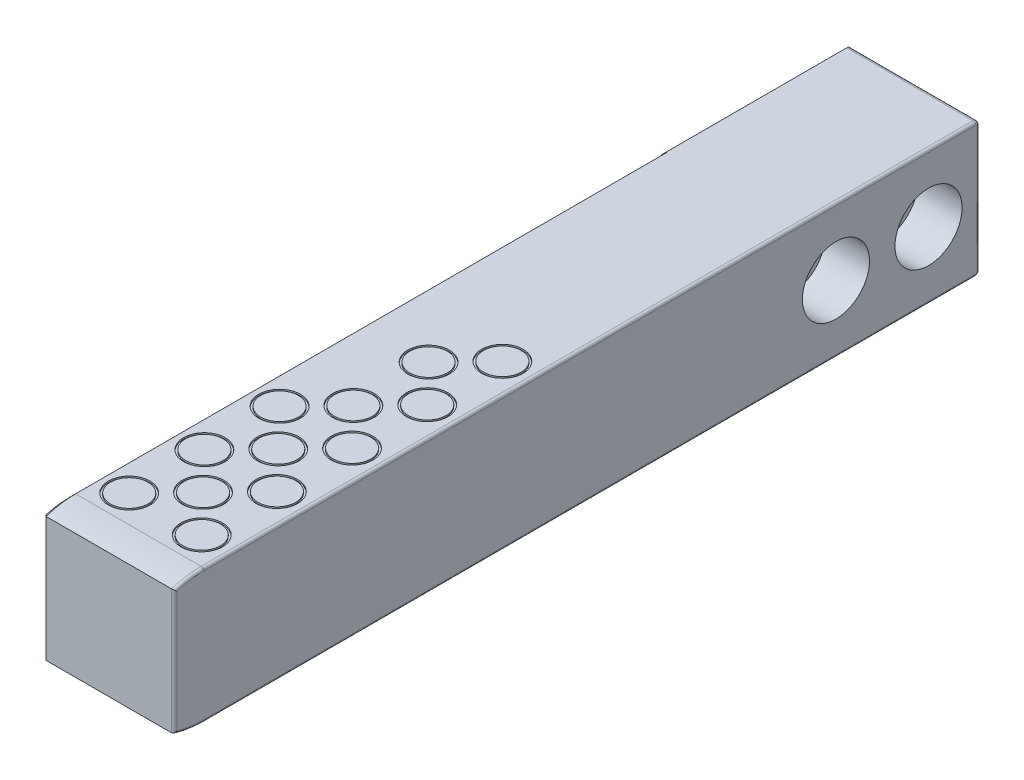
ISO-10303-21;
HEADER;
FILE_DESCRIPTION(('STEP AP214'),'2;1');
FILE_NAME('part.step','',(''),(''),'','','');
FILE_SCHEMA(('AUTOMOTIVE_DESIGN { 1 0 10303 214 1 1 1 1 }'));
ENDSEC;
DATA;
#1=APPLICATION_CONTEXT('core data for automotive mechanical design processes');
#2=APPLICATION_PROTOCOL_DEFINITION('international standard','automotive_design',2000,#1);
#3=PRODUCT_CONTEXT('',#1,'mechanical');
#4=PRODUCT('Part','Part','',(#3));
#5=PRODUCT_RELATED_PRODUCT_CATEGORY('part','',(#4));
#6=PRODUCT_DEFINITION_FORMATION('','',#4);
#7=PRODUCT_DEFINITION_CONTEXT('part definition',#1,'design');
#8=PRODUCT_DEFINITION('design','',#6,#7);
#9=PRODUCT_DEFINITION_SHAPE('','',#8);
#10=(LENGTH_UNIT() NAMED_UNIT(*) SI_UNIT(.MILLI.,.METRE.));
#11=(NAMED_UNIT(*) PLANE_ANGLE_UNIT() SI_UNIT($,.RADIAN.));
#12=(NAMED_UNIT(*) SI_UNIT($,.STERADIAN.) SOLID_ANGLE_UNIT());
#13=UNCERTAINTY_MEASURE_WITH_UNIT(LENGTH_MEASURE(1.E-05),#10,'distance_accuracy_value','');
#14=(GEOMETRIC_REPRESENTATION_CONTEXT(3) GLOBAL_UNCERTAINTY_ASSIGNED_CONTEXT((#13)) GLOBAL_UNIT_ASSIGNED_CONTEXT((#10,
#11,#12)) REPRESENTATION_CONTEXT('',''));
#15=CARTESIAN_POINT('',(0.,0.,0.));
#16=DIRECTION('',(0.,0.,1.));
#17=DIRECTION('',(1.,0.,0.));
#18=AXIS2_PLACEMENT_3D('',#15,#16,#17);
#19=CARTESIAN_POINT('',(-25.4,0.,-7.74699999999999));
#20=DIRECTION('',(1.,0.,0.));
#21=DIRECTION('',(0.,0.,-1.));
#22=AXIS2_PLACEMENT_3D('',#19,#20,#21);
#23=CYLINDRICAL_SURFACE('',#22,4.318);
#24=CARTESIAN_POINT('',(-25.4,0.,-7.74699999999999));
#25=DIRECTION('',(1.,0.,0.));
#26=DIRECTION('',(0.,0.,-1.));
#27=AXIS2_PLACEMENT_3D('',#24,#25,#26);
#28=CIRCLE('',#27,4.318);
#29=CARTESIAN_POINT('',(-25.4,0.,-12.065));
#30=VERTEX_POINT('',#29);
#31=EDGE_CURVE('E430',#30,#30,#28,.T.);
#32=ORIENTED_EDGE('',*,*,#31,.F.);
#33=EDGE_LOOP('',(#32));
#34=FACE_BOUND('',#33,.T.);
#35=CARTESIAN_POINT('',(-8.382,0.,-7.74699999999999));
#36=DIRECTION('',(1.,0.,0.));
#37=DIRECTION('',(0.,0.,-1.));
#38=AXIS2_PLACEMENT_3D('',#35,#36,#37);
#39=CIRCLE('',#38,4.318);
#40=CARTESIAN_POINT('',(-8.382,0.,-12.065));
#41=VERTEX_POINT('',#40);
#42=EDGE_CURVE('E338',#41,#41,#39,.F.);
#43=ORIENTED_EDGE('',*,*,#42,.F.);
#44=EDGE_LOOP('',(#43));
#45=FACE_BOUND('',#44,.T.);
#46=ADVANCED_FACE('F32',(#34,#45),#23,.F.);
#47=CARTESIAN_POINT('',(-25.4,0.,-25.273));
#48=DIRECTION('',(1.,0.,0.));
#49=DIRECTION('',(0.,0.,-1.));
#50=AXIS2_PLACEMENT_3D('',#47,#48,#49);
#51=CYLINDRICAL_SURFACE('',#50,4.318);
#52=CARTESIAN_POINT('',(-25.4,0.,-25.273));
#53=DIRECTION('',(1.,0.,0.));
#54=DIRECTION('',(0.,0.,-1.));
#55=AXIS2_PLACEMENT_3D('',#52,#53,#54);
#56=CIRCLE('',#55,4.318);
#57=CARTESIAN_POINT('',(-25.4,0.,-29.591));
#58=VERTEX_POINT('',#57);
#59=EDGE_CURVE('E381',#58,#58,#56,.T.);
#60=ORIENTED_EDGE('',*,*,#59,.F.);
#61=EDGE_LOOP('',(#60));
#62=FACE_BOUND('',#61,.T.);
#63=CARTESIAN_POINT('',(-8.382,0.,-25.273));
#64=DIRECTION('',(1.,0.,0.));
#65=DIRECTION('',(0.,0.,-1.));
#66=AXIS2_PLACEMENT_3D('',#63,#64,#65);
#67=CIRCLE('',#66,4.318);
#68=CARTESIAN_POINT('',(-8.382,0.,-29.591));
#69=VERTEX_POINT('',#68);
#70=EDGE_CURVE('E180',#69,#69,#67,.F.);
#71=ORIENTED_EDGE('',*,*,#70,.F.);
#72=EDGE_LOOP('',(#71));
#73=FACE_BOUND('',#72,.T.);
#74=ADVANCED_FACE('F762',(#62,#73),#51,.F.);
#75=CARTESIAN_POINT('',(-25.4,5.07999999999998,111.887));
#76=DIRECTION('',(1.,0.,0.));
#77=DIRECTION('',(0.,0.,-1.));
#78=AXIS2_PLACEMENT_3D('',#75,#76,#77);
#79=CYLINDRICAL_SURFACE('',#78,17.78);
#80=DIRECTION('',(1.,0.,0.));
#81=VECTOR('',#80,1.);
#82=CARTESIAN_POINT('',(-25.4,-11.7990596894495,117.475));
#83=LINE('',#82,#81);
#84=CARTESIAN_POINT('',(-24.257,-11.7990596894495,117.475));
#85=VERTEX_POINT('',#84);
#86=CARTESIAN_POINT('',(-0.508000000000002,-11.7990596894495,117.475));
#87=VERTEX_POINT('',#86);
#88=EDGE_CURVE('E190',#85,#87,#83,.T.);
#89=ORIENTED_EDGE('',*,*,#88,.F.);
#90=CARTESIAN_POINT('',(-24.257,5.07999999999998,111.887));
#91=DIRECTION('',(1.,0.,0.));
#92=DIRECTION('',(0.,0.,-1.));
#93=AXIS2_PLACEMENT_3D('',#90,#91,#92);
#94=CIRCLE('',#93,17.78);
#95=CARTESIAN_POINT('',(-24.257,-12.7,111.887));
#96=VERTEX_POINT('',#95);
#97=EDGE_CURVE('E321',#85,#96,#94,.T.);
#98=ORIENTED_EDGE('',*,*,#97,.T.);
#99=DIRECTION('',(1.,0.,0.));
#100=VECTOR('',#99,1.);
#101=CARTESIAN_POINT('',(-25.4,-12.7,111.887));
#102=LINE('',#101,#100);
#103=CARTESIAN_POINT('',(-0.508000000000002,-12.7,111.887));
#104=VERTEX_POINT('',#103);
#105=EDGE_CURVE('E377',#96,#104,#102,.T.);
#106=ORIENTED_EDGE('',*,*,#105,.T.);
#107=CARTESIAN_POINT('',(-0.508000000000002,5.07999999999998,111.887));
#108=DIRECTION('',(-1.,0.,0.));
#109=DIRECTION('',(0.,0.,1.));
#110=AXIS2_PLACEMENT_3D('',#107,#108,#109);
#111=CIRCLE('',#110,17.78);
#112=EDGE_CURVE('E220',#104,#87,#111,.T.);
#113=ORIENTED_EDGE('',*,*,#112,.T.);
#114=EDGE_LOOP('',(#89,#98,#106,#113));
#115=FACE_BOUND('',#114,.T.);
#116=ADVANCED_FACE('F375',(#115),#79,.T.);
#117=CARTESIAN_POINT('',(-25.4,-11.7990596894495,117.475));
#118=DIRECTION('',(0.,0.,1.));
#119=DIRECTION('',(0.,-1.,0.));
#120=AXIS2_PLACEMENT_3D('',#117,#118,#119);
#121=PLANE('',#120);
#122=DIRECTION('',(1.,0.,0.));
#123=VECTOR('',#122,1.);
#124=CARTESIAN_POINT('',(-25.4,11.7990596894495,117.475));
#125=LINE('',#124,#123);
#126=CARTESIAN_POINT('',(-24.257,11.7990596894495,117.475));
#127=VERTEX_POINT('',#126);
#128=CARTESIAN_POINT('',(-0.508000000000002,11.7990596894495,117.475));
#129=VERTEX_POINT('',#128);
#130=EDGE_CURVE('E369',#127,#129,#125,.T.);
#131=ORIENTED_EDGE('',*,*,#130,.F.);
#132=DIRECTION('',(0.,-1.,0.));
#133=VECTOR('',#132,1.);
#134=CARTESIAN_POINT('',(-24.257,-10.7252507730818,117.475));
#135=LINE('',#134,#133);
#136=EDGE_CURVE('E287',#127,#85,#135,.T.);
#137=ORIENTED_EDGE('',*,*,#136,.T.);
#138=ORIENTED_EDGE('',*,*,#88,.T.);
#139=DIRECTION('',(0.,-1.,0.));
#140=VECTOR('',#139,1.);
#141=CARTESIAN_POINT('',(-0.508,11.7990596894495,117.475));
#142=LINE('',#141,#140);
#143=EDGE_CURVE('E176',#87,#129,#142,.F.);
#144=ORIENTED_EDGE('',*,*,#143,.T.);
#145=EDGE_LOOP('',(#131,#137,#138,#144));
#146=FACE_BOUND('',#145,.T.);
#147=ADVANCED_FACE('F368',(#146),#121,.T.);
#148=CARTESIAN_POINT('',(-25.4,-5.08000000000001,111.887));
#149=DIRECTION('',(1.,0.,0.));
#150=DIRECTION('',(0.,0.,-1.));
#151=AXIS2_PLACEMENT_3D('',#148,#149,#150);
#152=CYLINDRICAL_SURFACE('',#151,17.78);
#153=DIRECTION('',(1.,0.,0.));
#154=VECTOR('',#153,1.);
#155=CARTESIAN_POINT('',(-25.4,12.7,111.887));
#156=LINE('',#155,#154);
#157=CARTESIAN_POINT('',(-24.257,12.7,111.887));
#158=VERTEX_POINT('',#157);
#159=CARTESIAN_POINT('',(-0.508000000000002,12.7,111.887));
#160=VERTEX_POINT('',#159);
#161=EDGE_CURVE('E407',#158,#160,#156,.T.);
#162=ORIENTED_EDGE('',*,*,#161,.F.);
#163=CARTESIAN_POINT('',(-24.257,-5.08000000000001,111.887));
#164=DIRECTION('',(1.,0.,0.));
#165=DIRECTION('',(0.,0.,-1.));
#166=AXIS2_PLACEMENT_3D('',#163,#164,#165);
#167=CIRCLE('',#166,17.78);
#168=EDGE_CURVE('E318',#158,#127,#167,.T.);
#169=ORIENTED_EDGE('',*,*,#168,.T.);
#170=ORIENTED_EDGE('',*,*,#130,.T.);
#171=CARTESIAN_POINT('',(-0.508000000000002,-5.08000000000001,111.887));
#172=DIRECTION('',(-1.,0.,0.));
#173=DIRECTION('',(0.,0.,1.));
#174=AXIS2_PLACEMENT_3D('',#171,#172,#173);
#175=CIRCLE('',#174,17.78);
#176=EDGE_CURVE('E197',#129,#160,#175,.T.);
#177=ORIENTED_EDGE('',*,*,#176,.T.);
#178=EDGE_LOOP('',(#162,#169,#170,#177));
#179=FACE_BOUND('',#178,.T.);
#180=ADVANCED_FACE('F750',(#179),#152,.T.);
#181=CARTESIAN_POINT('',(-25.4,12.7,111.887));
#182=DIRECTION('',(0.,1.,0.));
#183=DIRECTION('',(0.,0.,1.));
#184=AXIS2_PLACEMENT_3D('',#181,#182,#183);
#185=PLANE('',#184);
#186=DIRECTION('',(1.,0.,0.));
#187=VECTOR('',#186,1.);
#188=CARTESIAN_POINT('',(-25.4,12.7,-34.163));
#189=LINE('',#188,#187);
#190=CARTESIAN_POINT('',(-24.384,12.7,-34.163));
#191=VERTEX_POINT('',#190);
#192=CARTESIAN_POINT('',(-0.508000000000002,12.7,-34.163));
#193=VERTEX_POINT('',#192);
#194=EDGE_CURVE('E405',#191,#193,#189,.T.);
#195=ORIENTED_EDGE('',*,*,#194,.F.);
#196=DIRECTION('',(0.,0.,1.));
#197=VECTOR('',#196,1.);
#198=CARTESIAN_POINT('',(-24.384,12.7,111.887));
#199=LINE('',#198,#197);
#200=CARTESIAN_POINT('',(-24.384,12.7,0.));
#201=VERTEX_POINT('',#200);
#202=EDGE_CURVE('E11',#191,#201,#199,.T.);
#203=ORIENTED_EDGE('',*,*,#202,.T.);
#204=DIRECTION('',(-1.,0.,0.));
#205=VECTOR('',#204,1.);
#206=CARTESIAN_POINT('',(-25.4,12.7,0.));
#207=LINE('',#206,#205);
#208=CARTESIAN_POINT('',(-24.257,12.7,0.));
#209=VERTEX_POINT('',#208);
#210=EDGE_CURVE('E729',#209,#201,#207,.T.);
#211=ORIENTED_EDGE('',*,*,#210,.F.);
#212=DIRECTION('',(0.,0.,1.));
#213=VECTOR('',#212,1.);
#214=CARTESIAN_POINT('',(-24.257,12.7,111.887));
#215=LINE('',#214,#213);
#216=EDGE_CURVE('E316',#209,#158,#215,.T.);
#217=ORIENTED_EDGE('',*,*,#216,.T.);
#218=ORIENTED_EDGE('',*,*,#161,.T.);
#219=DIRECTION('',(0.,0.,1.));
#220=VECTOR('',#219,1.);
#221=CARTESIAN_POINT('',(-0.508,12.7,-34.163));
#222=LINE('',#221,#220);
#223=EDGE_CURVE('E205',#160,#193,#222,.F.);
#224=ORIENTED_EDGE('',*,*,#223,.T.);
#225=EDGE_LOOP('',(#195,#203,#211,#217,#218,#224));
#226=FACE_BOUND('',#225,.T.);
#227=CARTESIAN_POINT('',(-5.588,12.7,49.784));
#228=DIRECTION('',(0.,1.,0.));
#229=DIRECTION('',(0.,0.,-1.));
#230=AXIS2_PLACEMENT_3D('',#227,#228,#229);
#231=CIRCLE('',#230,3.93700000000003);
#232=CARTESIAN_POINT('',(-5.588,12.7,45.8469999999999));
#233=VERTEX_POINT('',#232);
#234=EDGE_CURVE('E566',#233,#233,#231,.T.);
#235=ORIENTED_EDGE('',*,*,#234,.F.);
#236=EDGE_LOOP('',(#235));
#237=FACE_BOUND('',#236,.T.);
#238=CARTESIAN_POINT('',(-12.446,12.7,56.896));
#239=DIRECTION('',(0.,1.,0.));
#240=DIRECTION('',(0.,0.,-1.));
#241=AXIS2_PLACEMENT_3D('',#238,#239,#240);
#242=CIRCLE('',#241,3.93700000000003);
#243=CARTESIAN_POINT('',(-12.446,12.7,52.9589999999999));
#244=VERTEX_POINT('',#243);
#245=EDGE_CURVE('E554',#244,#244,#242,.T.);
#246=ORIENTED_EDGE('',*,*,#245,.F.);
#247=EDGE_LOOP('',(#246));
#248=FACE_BOUND('',#247,.T.);
#249=CARTESIAN_POINT('',(-19.304,12.7,78.232));
#250=DIRECTION('',(0.,1.,0.));
#251=DIRECTION('',(0.,0.,1.));
#252=AXIS2_PLACEMENT_3D('',#249,#250,#251);
#253=CIRCLE('',#252,3.93700000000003);
#254=CARTESIAN_POINT('',(-19.304,12.7,82.169));
#255=VERTEX_POINT('',#254);
#256=EDGE_CURVE('E542',#255,#255,#253,.T.);
#257=ORIENTED_EDGE('',*,*,#256,.F.);
#258=EDGE_LOOP('',(#257));
#259=FACE_BOUND('',#258,.T.);
#260=CARTESIAN_POINT('',(-5.588,12.7,64.008));
#261=DIRECTION('',(0.,1.,0.));
#262=DIRECTION('',(0.,0.,-1.));
#263=AXIS2_PLACEMENT_3D('',#260,#261,#262);
#264=CIRCLE('',#263,3.93700000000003);
#265=CARTESIAN_POINT('',(-5.588,12.7,60.0709999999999));
#266=VERTEX_POINT('',#265);
#267=EDGE_CURVE('E530',#266,#266,#264,.T.);
#268=ORIENTED_EDGE('',*,*,#267,.F.);
#269=EDGE_LOOP('',(#268));
#270=FACE_BOUND('',#269,.T.);
#271=CARTESIAN_POINT('',(-12.446,12.7,71.12));
#272=DIRECTION('',(0.,1.,0.));
#273=DIRECTION('',(0.,0.,-1.));
#274=AXIS2_PLACEMENT_3D('',#271,#272,#273);
#275=CIRCLE('',#274,3.93700000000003);
#276=CARTESIAN_POINT('',(-12.446,12.7,67.1829999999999));
#277=VERTEX_POINT('',#276);
#278=EDGE_CURVE('E518',#277,#277,#275,.T.);
#279=ORIENTED_EDGE('',*,*,#278,.F.);
#280=EDGE_LOOP('',(#279));
#281=FACE_BOUND('',#280,.T.);
#282=CARTESIAN_POINT('',(-19.304,12.7,92.456));
#283=DIRECTION('',(0.,1.,0.));
#284=DIRECTION('',(0.,0.,1.));
#285=AXIS2_PLACEMENT_3D('',#282,#283,#284);
#286=CIRCLE('',#285,3.93700000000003);
#287=CARTESIAN_POINT('',(-19.304,12.7,96.393));
#288=VERTEX_POINT('',#287);
#289=EDGE_CURVE('E506',#288,#288,#286,.T.);
#290=ORIENTED_EDGE('',*,*,#289,.F.);
#291=EDGE_LOOP('',(#290));
#292=FACE_BOUND('',#291,.T.);
#293=CARTESIAN_POINT('',(-5.588,12.7,78.232));
#294=DIRECTION('',(0.,1.,0.));
#295=DIRECTION('',(0.,0.,-1.));
#296=AXIS2_PLACEMENT_3D('',#293,#294,#295);
#297=CIRCLE('',#296,3.93700000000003);
#298=CARTESIAN_POINT('',(-5.588,12.7,74.2949999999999));
#299=VERTEX_POINT('',#298);
#300=EDGE_CURVE('E494',#299,#299,#297,.T.);
#301=ORIENTED_EDGE('',*,*,#300,.F.);
#302=EDGE_LOOP('',(#301));
#303=FACE_BOUND('',#302,.T.);
#304=CARTESIAN_POINT('',(-12.446,12.7,85.344));
#305=DIRECTION('',(0.,1.,0.));
#306=DIRECTION('',(0.,0.,-1.));
#307=AXIS2_PLACEMENT_3D('',#304,#305,#306);
#308=CIRCLE('',#307,3.93700000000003);
#309=CARTESIAN_POINT('',(-12.446,12.7,81.4069999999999));
#310=VERTEX_POINT('',#309);
#311=EDGE_CURVE('E482',#310,#310,#308,.T.);
#312=ORIENTED_EDGE('',*,*,#311,.F.);
#313=EDGE_LOOP('',(#312));
#314=FACE_BOUND('',#313,.T.);
#315=CARTESIAN_POINT('',(-5.588,12.7,92.456));
#316=DIRECTION('',(0.,1.,0.));
#317=DIRECTION('',(0.,0.,1.));
#318=AXIS2_PLACEMENT_3D('',#315,#316,#317);
#319=CIRCLE('',#318,3.93700000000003);
#320=CARTESIAN_POINT('',(-5.588,12.7,96.393));
#321=VERTEX_POINT('',#320);
#322=EDGE_CURVE('E470',#321,#321,#319,.T.);
#323=ORIENTED_EDGE('',*,*,#322,.F.);
#324=EDGE_LOOP('',(#323));
#325=FACE_BOUND('',#324,.T.);
#326=CARTESIAN_POINT('',(-5.588,12.7,106.68));
#327=DIRECTION('',(0.,1.,0.));
#328=DIRECTION('',(0.,0.,-1.));
#329=AXIS2_PLACEMENT_3D('',#326,#327,#328);
#330=CIRCLE('',#329,3.93700000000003);
#331=CARTESIAN_POINT('',(-5.588,12.7,102.743));
#332=VERTEX_POINT('',#331);
#333=EDGE_CURVE('E458',#332,#332,#330,.T.);
#334=ORIENTED_EDGE('',*,*,#333,.F.);
#335=EDGE_LOOP('',(#334));
#336=FACE_BOUND('',#335,.T.);
#337=CARTESIAN_POINT('',(-12.446,12.7,99.568));
#338=DIRECTION('',(0.,1.,0.));
#339=DIRECTION('',(0.,0.,1.));
#340=AXIS2_PLACEMENT_3D('',#337,#338,#339);
#341=CIRCLE('',#340,3.93700000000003);
#342=CARTESIAN_POINT('',(-12.446,12.7,103.505));
#343=VERTEX_POINT('',#342);
#344=EDGE_CURVE('E446',#343,#343,#341,.T.);
#345=ORIENTED_EDGE('',*,*,#344,.F.);
#346=EDGE_LOOP('',(#345));
#347=FACE_BOUND('',#346,.T.);
#348=CARTESIAN_POINT('',(-19.304,12.7,106.68));
#349=DIRECTION('',(0.,1.,0.));
#350=DIRECTION('',(0.,0.,1.));
#351=AXIS2_PLACEMENT_3D('',#348,#349,#350);
#352=CIRCLE('',#351,3.93700000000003);
#353=CARTESIAN_POINT('',(-19.304,12.7,110.617));
#354=VERTEX_POINT('',#353);
#355=EDGE_CURVE('E434',#354,#354,#352,.T.);
#356=ORIENTED_EDGE('',*,*,#355,.F.);
#357=EDGE_LOOP('',(#356));
#358=FACE_BOUND('',#357,.T.);
#359=ADVANCED_FACE('F403',(#226,#237,#248,#259,#270,#281,#292,#303,#314,#325,#336,#347,#358),
#185,.T.);
#360=CARTESIAN_POINT('',(-25.4,11.938,-34.163));
#361=DIRECTION('',(1.,0.,0.));
#362=DIRECTION('',(0.,0.,-1.));
#363=AXIS2_PLACEMENT_3D('',#360,#361,#362);
#364=CYLINDRICAL_SURFACE('',#363,0.761999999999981);
#365=DIRECTION('',(1.,0.,0.));
#366=VECTOR('',#365,1.);
#367=CARTESIAN_POINT('',(-25.4,11.938,-34.925));
#368=LINE('',#367,#366);
#369=CARTESIAN_POINT('',(-24.384,11.938,-34.925));
#370=VERTEX_POINT('',#369);
#371=CARTESIAN_POINT('',(-0.508000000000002,11.938,-34.925));
#372=VERTEX_POINT('',#371);
#373=EDGE_CURVE('E411',#370,#372,#368,.T.);
#374=ORIENTED_EDGE('',*,*,#373,.F.);
#375=CARTESIAN_POINT('',(-25.146,11.938,-34.163));
#376=DIRECTION('',(0.707106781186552,0.,0.707106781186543));
#377=DIRECTION('',(0.707106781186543,0.,-0.707106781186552));
#378=AXIS2_PLACEMENT_3D('',#375,#376,#377);
#379=ELLIPSE('',#378,1.07763073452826,0.761999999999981);
#380=CARTESIAN_POINT('',(-24.6071846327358,12.4768153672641,-34.7018153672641));
#381=VERTEX_POINT('',#380);
#382=EDGE_CURVE('E41',#370,#381,#379,.T.);
#383=ORIENTED_EDGE('',*,*,#382,.T.);
#384=CARTESIAN_POINT('',(-25.1459999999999,11.938,-34.163));
#385=DIRECTION('',(0.707106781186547,-0.707106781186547,0.));
#386=DIRECTION('',(0.707106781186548,0.707106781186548,0.));
#387=AXIS2_PLACEMENT_3D('',#384,#385,#386);
#388=ELLIPSE('',#387,1.07763073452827,0.761999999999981);
#389=EDGE_CURVE('E52',#381,#191,#388,.T.);
#390=ORIENTED_EDGE('',*,*,#389,.T.);
#391=ORIENTED_EDGE('',*,*,#194,.T.);
#392=CARTESIAN_POINT('',(-0.508000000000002,11.938,-34.163));
#393=DIRECTION('',(-1.,0.,0.));
#394=DIRECTION('',(0.,0.,1.));
#395=AXIS2_PLACEMENT_3D('',#392,#393,#394);
#396=CIRCLE('',#395,0.761999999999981);
#397=EDGE_CURVE('E208',#193,#372,#396,.T.);
#398=ORIENTED_EDGE('',*,*,#397,.T.);
#399=EDGE_LOOP('',(#374,#383,#390,#391,#398));
#400=FACE_BOUND('',#399,.T.);
#401=ADVANCED_FACE('F410',(#400),#364,.T.);
#402=CARTESIAN_POINT('',(-25.4,-11.938,-34.925));
#403=DIRECTION('',(0.,0.,-1.));
#404=DIRECTION('',(-1.,0.,0.));
#405=AXIS2_PLACEMENT_3D('',#402,#403,#404);
#406=PLANE('',#405);
#407=DIRECTION('',(1.,0.,0.));
#408=VECTOR('',#407,1.);
#409=CARTESIAN_POINT('',(-25.4,-11.938,-34.925));
#410=LINE('',#409,#408);
#411=CARTESIAN_POINT('',(-24.384,-11.938,-34.925));
#412=VERTEX_POINT('',#411);
#413=CARTESIAN_POINT('',(-0.508000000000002,-11.938,-34.925));
#414=VERTEX_POINT('',#413);
#415=EDGE_CURVE('E418',#412,#414,#410,.T.);
#416=ORIENTED_EDGE('',*,*,#415,.F.);
#417=DIRECTION('',(0.,1.,0.));
#418=VECTOR('',#417,1.);
#419=CARTESIAN_POINT('',(-24.384,-11.938,-34.925));
#420=LINE('',#419,#418);
#421=EDGE_CURVE('E420',#412,#370,#420,.T.);
#422=ORIENTED_EDGE('',*,*,#421,.T.);
#423=ORIENTED_EDGE('',*,*,#373,.T.);
#424=DIRECTION('',(0.,1.,0.));
#425=VECTOR('',#424,1.);
#426=CARTESIAN_POINT('',(-0.508,-11.938,-34.925));
#427=LINE('',#426,#425);
#428=EDGE_CURVE('E211',#372,#414,#427,.F.);
#429=ORIENTED_EDGE('',*,*,#428,.T.);
#430=EDGE_LOOP('',(#416,#422,#423,#429));
#431=FACE_BOUND('',#430,.T.);
#432=ADVANCED_FACE('F417',(#431),#406,.T.);
#433=CARTESIAN_POINT('',(-25.4,-11.938,-34.163));
#434=DIRECTION('',(1.,0.,0.));
#435=DIRECTION('',(0.,0.,-1.));
#436=AXIS2_PLACEMENT_3D('',#433,#434,#435);
#437=CYLINDRICAL_SURFACE('',#436,0.761999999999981);
#438=DIRECTION('',(1.,0.,0.));
#439=VECTOR('',#438,1.);
#440=CARTESIAN_POINT('',(-25.4,-12.7,-34.163));
#441=LINE('',#440,#439);
#442=CARTESIAN_POINT('',(-24.384,-12.7,-34.163));
#443=VERTEX_POINT('',#442);
#444=CARTESIAN_POINT('',(-0.508000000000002,-12.7,-34.163));
#445=VERTEX_POINT('',#444);
#446=EDGE_CURVE('E380',#443,#445,#441,.T.);
#447=ORIENTED_EDGE('',*,*,#446,.F.);
#448=CARTESIAN_POINT('',(-25.1459999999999,-11.938,-34.163));
#449=DIRECTION('',(0.707106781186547,0.707106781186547,0.));
#450=DIRECTION('',(0.707106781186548,-0.707106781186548,0.));
#451=AXIS2_PLACEMENT_3D('',#448,#449,#450);
#452=ELLIPSE('',#451,1.07763073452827,0.761999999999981);
#453=CARTESIAN_POINT('',(-24.6071846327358,-12.4768153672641,-34.7018153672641));
#454=VERTEX_POINT('',#453);
#455=EDGE_CURVE('E1625',#443,#454,#452,.T.);
#456=ORIENTED_EDGE('',*,*,#455,.T.);
#457=CARTESIAN_POINT('',(-25.146,-11.938,-34.163));
#458=DIRECTION('',(0.707106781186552,0.,0.707106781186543));
#459=DIRECTION('',(0.707106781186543,0.,-0.707106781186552));
#460=AXIS2_PLACEMENT_3D('',#457,#458,#459);
#461=ELLIPSE('',#460,1.07763073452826,0.761999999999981);
#462=EDGE_CURVE('E1626',#454,#412,#461,.T.);
#463=ORIENTED_EDGE('',*,*,#462,.T.);
#464=ORIENTED_EDGE('',*,*,#415,.T.);
#465=CARTESIAN_POINT('',(-0.508000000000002,-11.938,-34.163));
#466=DIRECTION('',(-1.,0.,0.));
#467=DIRECTION('',(0.,0.,1.));
#468=AXIS2_PLACEMENT_3D('',#465,#466,#467);
#469=CIRCLE('',#468,0.761999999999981);
#470=EDGE_CURVE('E214',#414,#445,#469,.T.);
#471=ORIENTED_EDGE('',*,*,#470,.T.);
#472=EDGE_LOOP('',(#447,#456,#463,#464,#471));
#473=FACE_BOUND('',#472,.T.);
#474=ADVANCED_FACE('F1517',(#473),#437,.T.);
#475=CARTESIAN_POINT('',(-25.4,-12.7,111.887));
#476=DIRECTION('',(0.,-1.,0.));
#477=DIRECTION('',(0.,0.,-1.));
#478=AXIS2_PLACEMENT_3D('',#475,#476,#477);
#479=PLANE('',#478);
#480=DIRECTION('',(1.,0.,0.));
#481=VECTOR('',#480,1.);
#482=CARTESIAN_POINT('',(-25.4,-12.7,0.));
#483=LINE('',#482,#481);
#484=CARTESIAN_POINT('',(-24.384,-12.7,0.));
#485=VERTEX_POINT('',#484);
#486=CARTESIAN_POINT('',(-24.257,-12.7,0.));
#487=VERTEX_POINT('',#486);
#488=EDGE_CURVE('E732',#485,#487,#483,.T.);
#489=ORIENTED_EDGE('',*,*,#488,.F.);
#490=DIRECTION('',(0.,0.,-1.));
#491=VECTOR('',#490,1.);
#492=CARTESIAN_POINT('',(-24.384,-12.7,111.887));
#493=LINE('',#492,#491);
#494=EDGE_CURVE('E286',#485,#443,#493,.T.);
#495=ORIENTED_EDGE('',*,*,#494,.T.);
#496=ORIENTED_EDGE('',*,*,#446,.T.);
#497=DIRECTION('',(0.,0.,-1.));
#498=VECTOR('',#497,1.);
#499=CARTESIAN_POINT('',(-0.508,-12.7,111.887));
#500=LINE('',#499,#498);
#501=EDGE_CURVE('E217',#445,#104,#500,.F.);
#502=ORIENTED_EDGE('',*,*,#501,.T.);
#503=ORIENTED_EDGE('',*,*,#105,.F.);
#504=DIRECTION('',(0.,0.,-1.));
#505=VECTOR('',#504,1.);
#506=CARTESIAN_POINT('',(-24.257,-12.7,0.));
#507=LINE('',#506,#505);
#508=EDGE_CURVE('E323',#96,#487,#507,.T.);
#509=ORIENTED_EDGE('',*,*,#508,.T.);
#510=EDGE_LOOP('',(#489,#495,#496,#502,#503,#509));
#511=FACE_BOUND('',#510,.T.);
#512=CARTESIAN_POINT('',(-5.588,-12.7,49.784));
#513=DIRECTION('',(0.,1.,0.));
#514=DIRECTION('',(0.,0.,-1.));
#515=AXIS2_PLACEMENT_3D('',#512,#513,#514);
#516=CIRCLE('',#515,3.93700000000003);
#517=CARTESIAN_POINT('',(-5.588,-12.7,45.8469999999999));
#518=VERTEX_POINT('',#517);
#519=EDGE_CURVE('E710',#518,#518,#516,.T.);
#520=ORIENTED_EDGE('',*,*,#519,.T.);
#521=EDGE_LOOP('',(#520));
#522=FACE_BOUND('',#521,.T.);
#523=CARTESIAN_POINT('',(-12.446,-12.7,56.896));
#524=DIRECTION('',(0.,1.,0.));
#525=DIRECTION('',(0.,0.,-1.));
#526=AXIS2_PLACEMENT_3D('',#523,#524,#525);
#527=CIRCLE('',#526,3.93700000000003);
#528=CARTESIAN_POINT('',(-12.446,-12.7,52.9589999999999));
#529=VERTEX_POINT('',#528);
#530=EDGE_CURVE('E698',#529,#529,#527,.T.);
#531=ORIENTED_EDGE('',*,*,#530,.T.);
#532=EDGE_LOOP('',(#531));
#533=FACE_BOUND('',#532,.T.);
#534=CARTESIAN_POINT('',(-19.304,-12.7,78.232));
#535=DIRECTION('',(0.,1.,0.));
#536=DIRECTION('',(0.,0.,1.));
#537=AXIS2_PLACEMENT_3D('',#534,#535,#536);
#538=CIRCLE('',#537,3.93700000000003);
#539=CARTESIAN_POINT('',(-19.304,-12.7,82.169));
#540=VERTEX_POINT('',#539);
#541=EDGE_CURVE('E686',#540,#540,#538,.T.);
#542=ORIENTED_EDGE('',*,*,#541,.T.);
#543=EDGE_LOOP('',(#542));
#544=FACE_BOUND('',#543,.T.);
#545=CARTESIAN_POINT('',(-5.588,-12.7,64.008));
#546=DIRECTION('',(0.,1.,0.));
#547=DIRECTION('',(0.,0.,-1.));
#548=AXIS2_PLACEMENT_3D('',#545,#546,#547);
#549=CIRCLE('',#548,3.93700000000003);
#550=CARTESIAN_POINT('',(-5.588,-12.7,60.0709999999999));
#551=VERTEX_POINT('',#550);
#552=EDGE_CURVE('E674',#551,#551,#549,.T.);
#553=ORIENTED_EDGE('',*,*,#552,.T.);
#554=EDGE_LOOP('',(#553));
#555=FACE_BOUND('',#554,.T.);
#556=CARTESIAN_POINT('',(-12.446,-12.7,71.12));
#557=DIRECTION('',(0.,1.,0.));
#558=DIRECTION('',(0.,0.,-1.));
#559=AXIS2_PLACEMENT_3D('',#556,#557,#558);
#560=CIRCLE('',#559,3.93700000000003);
#561=CARTESIAN_POINT('',(-12.446,-12.7,67.1829999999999));
#562=VERTEX_POINT('',#561);
#563=EDGE_CURVE('E662',#562,#562,#560,.T.);
#564=ORIENTED_EDGE('',*,*,#563,.T.);
#565=EDGE_LOOP('',(#564));
#566=FACE_BOUND('',#565,.T.);
#567=CARTESIAN_POINT('',(-19.304,-12.7,92.456));
#568=DIRECTION('',(0.,1.,0.));
#569=DIRECTION('',(0.,0.,1.));
#570=AXIS2_PLACEMENT_3D('',#567,#568,#569);
#571=CIRCLE('',#570,3.93700000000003);
#572=CARTESIAN_POINT('',(-19.304,-12.7,96.393));
#573=VERTEX_POINT('',#572);
#574=EDGE_CURVE('E650',#573,#573,#571,.T.);
#575=ORIENTED_EDGE('',*,*,#574,.T.);
#576=EDGE_LOOP('',(#575));
#577=FACE_BOUND('',#576,.T.);
#578=CARTESIAN_POINT('',(-5.588,-12.7,78.232));
#579=DIRECTION('',(0.,1.,0.));
#580=DIRECTION('',(0.,0.,-1.));
#581=AXIS2_PLACEMENT_3D('',#578,#579,#580);
#582=CIRCLE('',#581,3.93700000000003);
#583=CARTESIAN_POINT('',(-5.588,-12.7,74.2949999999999));
#584=VERTEX_POINT('',#583);
#585=EDGE_CURVE('E638',#584,#584,#582,.T.);
#586=ORIENTED_EDGE('',*,*,#585,.T.);
#587=EDGE_LOOP('',(#586));
#588=FACE_BOUND('',#587,.T.);
#589=CARTESIAN_POINT('',(-12.446,-12.7,85.344));
#590=DIRECTION('',(0.,1.,0.));
#591=DIRECTION('',(0.,0.,-1.));
#592=AXIS2_PLACEMENT_3D('',#589,#590,#591);
#593=CIRCLE('',#592,3.93700000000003);
#594=CARTESIAN_POINT('',(-12.446,-12.7,81.4069999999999));
#595=VERTEX_POINT('',#594);
#596=EDGE_CURVE('E626',#595,#595,#593,.T.);
#597=ORIENTED_EDGE('',*,*,#596,.T.);
#598=EDGE_LOOP('',(#597));
#599=FACE_BOUND('',#598,.T.);
#600=CARTESIAN_POINT('',(-5.588,-12.7,92.456));
#601=DIRECTION('',(0.,1.,0.));
#602=DIRECTION('',(0.,0.,1.));
#603=AXIS2_PLACEMENT_3D('',#600,#601,#602);
#604=CIRCLE('',#603,3.93700000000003);
#605=CARTESIAN_POINT('',(-5.588,-12.7,96.393));
#606=VERTEX_POINT('',#605);
#607=EDGE_CURVE('E614',#606,#606,#604,.T.);
#608=ORIENTED_EDGE('',*,*,#607,.T.);
#609=EDGE_LOOP('',(#608));
#610=FACE_BOUND('',#609,.T.);
#611=CARTESIAN_POINT('',(-5.588,-12.7,106.68));
#612=DIRECTION('',(0.,1.,0.));
#613=DIRECTION('',(0.,0.,-1.));
#614=AXIS2_PLACEMENT_3D('',#611,#612,#613);
#615=CIRCLE('',#614,3.93700000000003);
#616=CARTESIAN_POINT('',(-5.588,-12.7,102.743));
#617=VERTEX_POINT('',#616);
#618=EDGE_CURVE('E602',#617,#617,#615,.T.);
#619=ORIENTED_EDGE('',*,*,#618,.T.);
#620=EDGE_LOOP('',(#619));
#621=FACE_BOUND('',#620,.T.);
#622=CARTESIAN_POINT('',(-12.446,-12.7,99.568));
#623=DIRECTION('',(0.,1.,0.));
#624=DIRECTION('',(0.,0.,1.));
#625=AXIS2_PLACEMENT_3D('',#622,#623,#624);
#626=CIRCLE('',#625,3.93700000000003);
#627=CARTESIAN_POINT('',(-12.446,-12.7,103.505));
#628=VERTEX_POINT('',#627);
#629=EDGE_CURVE('E590',#628,#628,#626,.T.);
#630=ORIENTED_EDGE('',*,*,#629,.T.);
#631=EDGE_LOOP('',(#630));
#632=FACE_BOUND('',#631,.T.);
#633=CARTESIAN_POINT('',(-19.304,-12.7,106.68));
#634=DIRECTION('',(0.,1.,0.));
#635=DIRECTION('',(0.,0.,1.));
#636=AXIS2_PLACEMENT_3D('',#633,#634,#635);
#637=CIRCLE('',#636,3.93700000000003);
#638=CARTESIAN_POINT('',(-19.304,-12.7,110.617));
#639=VERTEX_POINT('',#638);
#640=EDGE_CURVE('E578',#639,#639,#637,.T.);
#641=ORIENTED_EDGE('',*,*,#640,.T.);
#642=EDGE_LOOP('',(#641));
#643=FACE_BOUND('',#642,.T.);
#644=ADVANCED_FACE('F385',(#511,#522,#533,#544,#555,#566,#577,#588,#599,#610,#621,#632,#643),
#479,.T.);
#645=CARTESIAN_POINT('',(-25.4,5.07999999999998,111.887));
#646=DIRECTION('',(-1.,0.,0.));
#647=DIRECTION('',(0.,0.,1.));
#648=AXIS2_PLACEMENT_3D('',#645,#646,#647);
#649=PLANE('',#648);
#650=DIRECTION('',(0.,-1.,0.));
#651=VECTOR('',#650,1.);
#652=CARTESIAN_POINT('',(-25.4,5.07999999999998,-33.909));
#653=LINE('',#652,#651);
#654=CARTESIAN_POINT('',(-25.4,11.684,-33.909));
#655=VERTEX_POINT('',#654);
#656=CARTESIAN_POINT('',(-25.4,-11.684,-33.909));
#657=VERTEX_POINT('',#656);
#658=EDGE_CURVE('E1615',#655,#657,#653,.T.);
#659=ORIENTED_EDGE('',*,*,#658,.T.);
#660=DIRECTION('',(0.,0.,1.));
#661=VECTOR('',#660,1.);
#662=CARTESIAN_POINT('',(-25.4,-11.684,111.887));
#663=LINE('',#662,#661);
#664=CARTESIAN_POINT('',(-25.4,-11.684,0.));
#665=VERTEX_POINT('',#664);
#666=EDGE_CURVE('E1602',#657,#665,#663,.T.);
#667=ORIENTED_EDGE('',*,*,#666,.T.);
#668=DIRECTION('',(0.,-1.,0.));
#669=VECTOR('',#668,1.);
#670=CARTESIAN_POINT('',(-25.4,5.07999999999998,0.));
#671=LINE('',#670,#669);
#672=CARTESIAN_POINT('',(-25.4,11.684,0.));
#673=VERTEX_POINT('',#672);
#674=EDGE_CURVE('E222',#673,#665,#671,.T.);
#675=ORIENTED_EDGE('',*,*,#674,.F.);
#676=DIRECTION('',(0.,0.,-1.));
#677=VECTOR('',#676,1.);
#678=CARTESIAN_POINT('',(-25.4,11.684,111.887));
#679=LINE('',#678,#677);
#680=EDGE_CURVE('E1618',#673,#655,#679,.T.);
#681=ORIENTED_EDGE('',*,*,#680,.T.);
#682=EDGE_LOOP('',(#659,#667,#675,#681));
#683=FACE_BOUND('',#682,.T.);
#684=ORIENTED_EDGE('',*,*,#31,.T.);
#685=EDGE_LOOP('',(#684));
#686=FACE_BOUND('',#685,.T.);
#687=ORIENTED_EDGE('',*,*,#59,.T.);
#688=EDGE_LOOP('',(#687));
#689=FACE_BOUND('',#688,.T.);
#690=ADVANCED_FACE('F776',(#683,#686,#689),#649,.T.);
#691=CARTESIAN_POINT('',(0.,5.07999999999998,111.887));
#692=DIRECTION('',(-1.,0.,0.));
#693=DIRECTION('',(0.,0.,1.));
#694=AXIS2_PLACEMENT_3D('',#691,#692,#693);
#695=PLANE('',#694);
#696=CARTESIAN_POINT('',(0.,0.,-7.74699999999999));
#697=DIRECTION('',(-1.,0.,0.));
#698=DIRECTION('',(0.,0.,1.));
#699=AXIS2_PLACEMENT_3D('',#696,#697,#698);
#700=CIRCLE('',#699,6.35);
#701=CARTESIAN_POINT('',(0.,0.,-1.39699999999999));
#702=VERTEX_POINT('',#701);
#703=EDGE_CURVE('E726',#702,#702,#700,.T.);
#704=ORIENTED_EDGE('',*,*,#703,.T.);
#705=EDGE_LOOP('',(#704));
#706=FACE_BOUND('',#705,.T.);
#707=CARTESIAN_POINT('',(0.,0.,-25.273));
#708=DIRECTION('',(-1.,0.,0.));
#709=DIRECTION('',(0.,0.,1.));
#710=AXIS2_PLACEMENT_3D('',#707,#708,#709);
#711=CIRCLE('',#710,6.35);
#712=CARTESIAN_POINT('',(0.,0.,-18.923));
#713=VERTEX_POINT('',#712);
#714=EDGE_CURVE('E341',#713,#713,#711,.T.);
#715=ORIENTED_EDGE('',*,*,#714,.T.);
#716=EDGE_LOOP('',(#715));
#717=FACE_BOUND('',#716,.T.);
#718=CARTESIAN_POINT('',(0.,-5.08000000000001,111.887));
#719=DIRECTION('',(-1.,0.,0.));
#720=DIRECTION('',(0.,0.,1.));
#721=AXIS2_PLACEMENT_3D('',#718,#719,#720);
#722=CIRCLE('',#721,17.272);
#723=CARTESIAN_POINT('',(0.,12.192,111.887));
#724=VERTEX_POINT('',#723);
#725=CARTESIAN_POINT('',(0.,11.4280460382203,116.967));
#726=VERTEX_POINT('',#725);
#727=EDGE_CURVE('E194',#724,#726,#722,.F.);
#728=ORIENTED_EDGE('',*,*,#727,.T.);
#729=DIRECTION('',(0.,-1.,0.));
#730=VECTOR('',#729,1.);
#731=CARTESIAN_POINT('',(0.,-11.7990596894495,116.967));
#732=LINE('',#731,#730);
#733=CARTESIAN_POINT('',(0.,-11.4280460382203,116.967));
#734=VERTEX_POINT('',#733);
#735=EDGE_CURVE('E174',#726,#734,#732,.T.);
#736=ORIENTED_EDGE('',*,*,#735,.T.);
#737=CARTESIAN_POINT('',(0.,5.07999999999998,111.887));
#738=DIRECTION('',(-1.,0.,0.));
#739=DIRECTION('',(0.,0.,1.));
#740=AXIS2_PLACEMENT_3D('',#737,#738,#739);
#741=CIRCLE('',#740,17.272);
#742=CARTESIAN_POINT('',(0.,-12.192,111.887));
#743=VERTEX_POINT('',#742);
#744=EDGE_CURVE('E183',#734,#743,#741,.F.);
#745=ORIENTED_EDGE('',*,*,#744,.T.);
#746=DIRECTION('',(0.,0.,-1.));
#747=VECTOR('',#746,1.);
#748=CARTESIAN_POINT('',(0.,-12.192,-34.163));
#749=LINE('',#748,#747);
#750=CARTESIAN_POINT('',(0.,-12.192,-34.163));
#751=VERTEX_POINT('',#750);
#752=EDGE_CURVE('E189',#743,#751,#749,.T.);
#753=ORIENTED_EDGE('',*,*,#752,.T.);
#754=CARTESIAN_POINT('',(0.,-11.938,-34.163));
#755=DIRECTION('',(-1.,0.,0.));
#756=DIRECTION('',(0.,0.,1.));
#757=AXIS2_PLACEMENT_3D('',#754,#755,#756);
#758=CIRCLE('',#757,0.253999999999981);
#759=CARTESIAN_POINT('',(0.,-11.938,-34.417));
#760=VERTEX_POINT('',#759);
#761=EDGE_CURVE('E391',#751,#760,#758,.F.);
#762=ORIENTED_EDGE('',*,*,#761,.T.);
#763=DIRECTION('',(0.,1.,0.));
#764=VECTOR('',#763,1.);
#765=CARTESIAN_POINT('',(0.,11.938,-34.417));
#766=LINE('',#765,#764);
#767=CARTESIAN_POINT('',(0.,11.938,-34.417));
#768=VERTEX_POINT('',#767);
#769=EDGE_CURVE('E393',#760,#768,#766,.T.);
#770=ORIENTED_EDGE('',*,*,#769,.T.);
#771=CARTESIAN_POINT('',(0.,11.938,-34.163));
#772=DIRECTION('',(-1.,0.,0.));
#773=DIRECTION('',(0.,0.,1.));
#774=AXIS2_PLACEMENT_3D('',#771,#772,#773);
#775=CIRCLE('',#774,0.253999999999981);
#776=CARTESIAN_POINT('',(0.,12.192,-34.163));
#777=VERTEX_POINT('',#776);
#778=EDGE_CURVE('E397',#768,#777,#775,.F.);
#779=ORIENTED_EDGE('',*,*,#778,.T.);
#780=DIRECTION('',(0.,0.,1.));
#781=VECTOR('',#780,1.);
#782=CARTESIAN_POINT('',(0.,12.192,111.887));
#783=LINE('',#782,#781);
#784=EDGE_CURVE('E199',#777,#724,#783,.T.);
#785=ORIENTED_EDGE('',*,*,#784,.T.);
#786=EDGE_LOOP('',(#728,#736,#745,#753,#762,#770,#779,#785));
#787=FACE_BOUND('',#786,.T.);
#788=ADVANCED_FACE('F192',(#706,#717,#787),#695,.F.);
#789=CARTESIAN_POINT('',(-19.304,12.4206,106.68));
#790=DIRECTION('',(0.,1.,0.));
#791=DIRECTION('',(0.,0.,1.));
#792=AXIS2_PLACEMENT_3D('',#789,#790,#791);
#793=CYLINDRICAL_SURFACE('',#792,3.93700000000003);
#794=CARTESIAN_POINT('',(-19.304,12.4206,106.68));
#795=DIRECTION('',(0.,1.,0.));
#796=DIRECTION('',(0.,0.,1.));
#797=AXIS2_PLACEMENT_3D('',#794,#795,#796);
#798=CIRCLE('',#797,3.93700000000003);
#799=CARTESIAN_POINT('',(-19.304,12.4206,110.617));
#800=VERTEX_POINT('',#799);
#801=EDGE_CURVE('E433',#800,#800,#798,.T.);
#802=ORIENTED_EDGE('',*,*,#801,.F.);
#803=EDGE_LOOP('',(#802));
#804=FACE_BOUND('',#803,.T.);
#805=ORIENTED_EDGE('',*,*,#355,.T.);
#806=EDGE_LOOP('',(#805));
#807=FACE_BOUND('',#806,.T.);
#808=ADVANCED_FACE('F773',(#804,#807),#793,.F.);
#809=CARTESIAN_POINT('',(-19.304,12.4206,106.68));
#810=DIRECTION('',(0.,1.,0.));
#811=DIRECTION('',(0.,0.,1.));
#812=AXIS2_PLACEMENT_3D('',#809,#810,#811);
#813=PLANE('',#812);
#814=CARTESIAN_POINT('',(-19.304,12.4206,106.68));
#815=DIRECTION('',(0.,1.,0.));
#816=DIRECTION('',(0.,0.,1.));
#817=AXIS2_PLACEMENT_3D('',#814,#815,#816);
#818=CIRCLE('',#817,3.55599999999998);
#819=CARTESIAN_POINT('',(-19.304,12.4206,110.236));
#820=VERTEX_POINT('',#819);
#821=EDGE_CURVE('E437',#820,#820,#818,.T.);
#822=ORIENTED_EDGE('',*,*,#821,.F.);
#823=EDGE_LOOP('',(#822));
#824=FACE_BOUND('',#823,.T.);
#825=ORIENTED_EDGE('',*,*,#801,.T.);
#826=EDGE_LOOP('',(#825));
#827=FACE_BOUND('',#826,.T.);
#828=ADVANCED_FACE('F785',(#824,#827),#813,.T.);
#829=CARTESIAN_POINT('',(-19.304,12.4206,106.68));
#830=DIRECTION('',(0.,1.,0.));
#831=DIRECTION('',(0.,0.,1.));
#832=AXIS2_PLACEMENT_3D('',#829,#830,#831);
#833=CYLINDRICAL_SURFACE('',#832,3.55599999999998);
#834=ORIENTED_EDGE('',*,*,#821,.T.);
#835=EDGE_LOOP('',(#834));
#836=FACE_BOUND('',#835,.T.);
#837=CARTESIAN_POINT('',(-19.304,12.7,106.68));
#838=DIRECTION('',(0.,1.,0.));
#839=DIRECTION('',(0.,0.,1.));
#840=AXIS2_PLACEMENT_3D('',#837,#838,#839);
#841=CIRCLE('',#840,3.55599999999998);
#842=CARTESIAN_POINT('',(-19.304,12.7,110.236));
#843=VERTEX_POINT('',#842);
#844=EDGE_CURVE('E440',#843,#843,#841,.T.);
#845=ORIENTED_EDGE('',*,*,#844,.F.);
#846=EDGE_LOOP('',(#845));
#847=FACE_BOUND('',#846,.T.);
#848=ADVANCED_FACE('F1105',(#836,#847),#833,.T.);
#849=ORIENTED_EDGE('',*,*,#844,.T.);
#850=EDGE_LOOP('',(#849));
#851=FACE_BOUND('',#850,.T.);
#852=ADVANCED_FACE('F759',(#851),#185,.T.);
#853=CARTESIAN_POINT('',(-12.446,12.4206,99.568));
#854=DIRECTION('',(0.,1.,0.));
#855=DIRECTION('',(0.,0.,1.));
#856=AXIS2_PLACEMENT_3D('',#853,#854,#855);
#857=CYLINDRICAL_SURFACE('',#856,3.93700000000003);
#858=CARTESIAN_POINT('',(-12.446,12.4206,99.568));
#859=DIRECTION('',(0.,1.,0.));
#860=DIRECTION('',(0.,0.,1.));
#861=AXIS2_PLACEMENT_3D('',#858,#859,#860);
#862=CIRCLE('',#861,3.93700000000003);
#863=CARTESIAN_POINT('',(-12.446,12.4206,103.505));
#864=VERTEX_POINT('',#863);
#865=EDGE_CURVE('E443',#864,#864,#862,.T.);
#866=ORIENTED_EDGE('',*,*,#865,.F.);
#867=EDGE_LOOP('',(#866));
#868=FACE_BOUND('',#867,.T.);
#869=ORIENTED_EDGE('',*,*,#344,.T.);
#870=EDGE_LOOP('',(#869));
#871=FACE_BOUND('',#870,.T.);
#872=ADVANCED_FACE('F1100',(#868,#871),#857,.F.);
#873=CARTESIAN_POINT('',(-12.446,12.4206,99.568));
#874=DIRECTION('',(0.,1.,0.));
#875=DIRECTION('',(0.,0.,1.));
#876=AXIS2_PLACEMENT_3D('',#873,#874,#875);
#877=PLANE('',#876);
#878=CARTESIAN_POINT('',(-12.446,12.4206,99.568));
#879=DIRECTION('',(0.,1.,0.));
#880=DIRECTION('',(0.,0.,1.));
#881=AXIS2_PLACEMENT_3D('',#878,#879,#880);
#882=CIRCLE('',#881,3.55599999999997);
#883=CARTESIAN_POINT('',(-12.446,12.4206,103.124));
#884=VERTEX_POINT('',#883);
#885=EDGE_CURVE('E449',#884,#884,#882,.T.);
#886=ORIENTED_EDGE('',*,*,#885,.F.);
#887=EDGE_LOOP('',(#886));
#888=FACE_BOUND('',#887,.T.);
#889=ORIENTED_EDGE('',*,*,#865,.T.);
#890=EDGE_LOOP('',(#889));
#891=FACE_BOUND('',#890,.T.);
#892=ADVANCED_FACE('F1096',(#888,#891),#877,.T.);
#893=CARTESIAN_POINT('',(-12.446,12.4206,99.568));
#894=DIRECTION('',(0.,1.,0.));
#895=DIRECTION('',(0.,0.,1.));
#896=AXIS2_PLACEMENT_3D('',#893,#894,#895);
#897=CYLINDRICAL_SURFACE('',#896,3.55599999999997);
#898=ORIENTED_EDGE('',*,*,#885,.T.);
#899=EDGE_LOOP('',(#898));
#900=FACE_BOUND('',#899,.T.);
#901=CARTESIAN_POINT('',(-12.446,12.7,99.568));
#902=DIRECTION('',(0.,1.,0.));
#903=DIRECTION('',(0.,0.,1.));
#904=AXIS2_PLACEMENT_3D('',#901,#902,#903);
#905=CIRCLE('',#904,3.55599999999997);
#906=CARTESIAN_POINT('',(-12.446,12.7,103.124));
#907=VERTEX_POINT('',#906);
#908=EDGE_CURVE('E452',#907,#907,#905,.T.);
#909=ORIENTED_EDGE('',*,*,#908,.F.);
#910=EDGE_LOOP('',(#909));
#911=FACE_BOUND('',#910,.T.);
#912=ADVANCED_FACE('F1093',(#900,#911),#897,.T.);
#913=ORIENTED_EDGE('',*,*,#908,.T.);
#914=EDGE_LOOP('',(#913));
#915=FACE_BOUND('',#914,.T.);
#916=ADVANCED_FACE('F1091',(#915),#185,.T.);
#917=CARTESIAN_POINT('',(-5.588,12.4206,106.68));
#918=DIRECTION('',(0.,1.,0.));
#919=DIRECTION('',(0.,0.,1.));
#920=AXIS2_PLACEMENT_3D('',#917,#918,#919);
#921=CYLINDRICAL_SURFACE('',#920,3.93700000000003);
#922=CARTESIAN_POINT('',(-5.588,12.4206,106.68));
#923=DIRECTION('',(0.,1.,0.));
#924=DIRECTION('',(0.,0.,-1.));
#925=AXIS2_PLACEMENT_3D('',#922,#923,#924);
#926=CIRCLE('',#925,3.93700000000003);
#927=CARTESIAN_POINT('',(-5.588,12.4206,102.743));
#928=VERTEX_POINT('',#927);
#929=EDGE_CURVE('E455',#928,#928,#926,.T.);
#930=ORIENTED_EDGE('',*,*,#929,.F.);
#931=EDGE_LOOP('',(#930));
#932=FACE_BOUND('',#931,.T.);
#933=ORIENTED_EDGE('',*,*,#333,.T.);
#934=EDGE_LOOP('',(#933));
#935=FACE_BOUND('',#934,.T.);
#936=ADVANCED_FACE('F1087',(#932,#935),#921,.F.);
#937=CARTESIAN_POINT('',(-5.588,12.4206,106.68));
#938=DIRECTION('',(0.,-1.,0.));
#939=DIRECTION('',(0.,0.,-1.));
#940=AXIS2_PLACEMENT_3D('',#937,#938,#939);
#941=PLANE('',#940);
#942=CARTESIAN_POINT('',(-5.588,12.4206,106.68));
#943=DIRECTION('',(0.,1.,0.));
#944=DIRECTION('',(0.,0.,-1.));
#945=AXIS2_PLACEMENT_3D('',#942,#943,#944);
#946=CIRCLE('',#945,3.55599999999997);
#947=CARTESIAN_POINT('',(-5.588,12.4206,103.124));
#948=VERTEX_POINT('',#947);
#949=EDGE_CURVE('E461',#948,#948,#946,.T.);
#950=ORIENTED_EDGE('',*,*,#949,.F.);
#951=EDGE_LOOP('',(#950));
#952=FACE_BOUND('',#951,.T.);
#953=ORIENTED_EDGE('',*,*,#929,.T.);
#954=EDGE_LOOP('',(#953));
#955=FACE_BOUND('',#954,.T.);
#956=ADVANCED_FACE('F1083',(#952,#955),#941,.F.);
#957=CARTESIAN_POINT('',(-5.588,12.4206,106.68));
#958=DIRECTION('',(0.,1.,0.));
#959=DIRECTION('',(0.,0.,1.));
#960=AXIS2_PLACEMENT_3D('',#957,#958,#959);
#961=CYLINDRICAL_SURFACE('',#960,3.55599999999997);
#962=ORIENTED_EDGE('',*,*,#949,.T.);
#963=EDGE_LOOP('',(#962));
#964=FACE_BOUND('',#963,.T.);
#965=CARTESIAN_POINT('',(-5.588,12.7,106.68));
#966=DIRECTION('',(0.,1.,0.));
#967=DIRECTION('',(0.,0.,-1.));
#968=AXIS2_PLACEMENT_3D('',#965,#966,#967);
#969=CIRCLE('',#968,3.55599999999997);
#970=CARTESIAN_POINT('',(-5.588,12.7,103.124));
#971=VERTEX_POINT('',#970);
#972=EDGE_CURVE('E464',#971,#971,#969,.T.);
#973=ORIENTED_EDGE('',*,*,#972,.F.);
#974=EDGE_LOOP('',(#973));
#975=FACE_BOUND('',#974,.T.);
#976=ADVANCED_FACE('F1080',(#964,#975),#961,.T.);
#977=ORIENTED_EDGE('',*,*,#972,.T.);
#978=EDGE_LOOP('',(#977));
#979=FACE_BOUND('',#978,.T.);
#980=ADVANCED_FACE('F1078',(#979),#185,.T.);
#981=CARTESIAN_POINT('',(-5.588,12.4206,92.456));
#982=DIRECTION('',(0.,1.,0.));
#983=DIRECTION('',(0.,0.,1.));
#984=AXIS2_PLACEMENT_3D('',#981,#982,#983);
#985=CYLINDRICAL_SURFACE('',#984,3.93700000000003);
#986=CARTESIAN_POINT('',(-5.588,12.4206,92.456));
#987=DIRECTION('',(0.,1.,0.));
#988=DIRECTION('',(0.,0.,1.));
#989=AXIS2_PLACEMENT_3D('',#986,#987,#988);
#990=CIRCLE('',#989,3.93700000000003);
#991=CARTESIAN_POINT('',(-5.588,12.4206,96.393));
#992=VERTEX_POINT('',#991);
#993=EDGE_CURVE('E467',#992,#992,#990,.T.);
#994=ORIENTED_EDGE('',*,*,#993,.F.);
#995=EDGE_LOOP('',(#994));
#996=FACE_BOUND('',#995,.T.);
#997=ORIENTED_EDGE('',*,*,#322,.T.);
#998=EDGE_LOOP('',(#997));
#999=FACE_BOUND('',#998,.T.);
#1000=ADVANCED_FACE('F1074',(#996,#999),#985,.F.);
#1001=CARTESIAN_POINT('',(-5.588,12.4206,92.456));
#1002=DIRECTION('',(0.,1.,0.));
#1003=DIRECTION('',(0.,0.,1.));
#1004=AXIS2_PLACEMENT_3D('',#1001,#1002,#1003);
#1005=PLANE('',#1004);
#1006=CARTESIAN_POINT('',(-5.588,12.4206,92.456));
#1007=DIRECTION('',(0.,1.,0.));
#1008=DIRECTION('',(0.,0.,1.));
#1009=AXIS2_PLACEMENT_3D('',#1006,#1007,#1008);
#1010=CIRCLE('',#1009,3.55599999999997);
#1011=CARTESIAN_POINT('',(-5.588,12.4206,96.012));
#1012=VERTEX_POINT('',#1011);
#1013=EDGE_CURVE('E473',#1012,#1012,#1010,.T.);
#1014=ORIENTED_EDGE('',*,*,#1013,.F.);
#1015=EDGE_LOOP('',(#1014));
#1016=FACE_BOUND('',#1015,.T.);
#1017=ORIENTED_EDGE('',*,*,#993,.T.);
#1018=EDGE_LOOP('',(#1017));
#1019=FACE_BOUND('',#1018,.T.);
#1020=ADVANCED_FACE('F1070',(#1016,#1019),#1005,.T.);
#1021=CARTESIAN_POINT('',(-5.588,12.4206,92.456));
#1022=DIRECTION('',(0.,1.,0.));
#1023=DIRECTION('',(0.,0.,1.));
#1024=AXIS2_PLACEMENT_3D('',#1021,#1022,#1023);
#1025=CYLINDRICAL_SURFACE('',#1024,3.55599999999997);
#1026=ORIENTED_EDGE('',*,*,#1013,.T.);
#1027=EDGE_LOOP('',(#1026));
#1028=FACE_BOUND('',#1027,.T.);
#1029=CARTESIAN_POINT('',(-5.588,12.7,92.456));
#1030=DIRECTION('',(0.,1.,0.));
#1031=DIRECTION('',(0.,0.,1.));
#1032=AXIS2_PLACEMENT_3D('',#1029,#1030,#1031);
#1033=CIRCLE('',#1032,3.55599999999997);
#1034=CARTESIAN_POINT('',(-5.588,12.7,96.012));
#1035=VERTEX_POINT('',#1034);
#1036=EDGE_CURVE('E476',#1035,#1035,#1033,.T.);
#1037=ORIENTED_EDGE('',*,*,#1036,.F.);
#1038=EDGE_LOOP('',(#1037));
#1039=FACE_BOUND('',#1038,.T.);
#1040=ADVANCED_FACE('F1067',(#1028,#1039),#1025,.T.);
#1041=ORIENTED_EDGE('',*,*,#1036,.T.);
#1042=EDGE_LOOP('',(#1041));
#1043=FACE_BOUND('',#1042,.T.);
#1044=ADVANCED_FACE('F1065',(#1043),#185,.T.);
#1045=CARTESIAN_POINT('',(-12.446,12.4206,85.344));
#1046=DIRECTION('',(0.,1.,0.));
#1047=DIRECTION('',(0.,0.,1.));
#1048=AXIS2_PLACEMENT_3D('',#1045,#1046,#1047);
#1049=CYLINDRICAL_SURFACE('',#1048,3.93700000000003);
#1050=CARTESIAN_POINT('',(-12.446,12.4206,85.344));
#1051=DIRECTION('',(0.,1.,0.));
#1052=DIRECTION('',(0.,0.,-1.));
#1053=AXIS2_PLACEMENT_3D('',#1050,#1051,#1052);
#1054=CIRCLE('',#1053,3.93700000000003);
#1055=CARTESIAN_POINT('',(-12.446,12.4206,81.4069999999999));
#1056=VERTEX_POINT('',#1055);
#1057=EDGE_CURVE('E479',#1056,#1056,#1054,.T.);
#1058=ORIENTED_EDGE('',*,*,#1057,.F.);
#1059=EDGE_LOOP('',(#1058));
#1060=FACE_BOUND('',#1059,.T.);
#1061=ORIENTED_EDGE('',*,*,#311,.T.);
#1062=EDGE_LOOP('',(#1061));
#1063=FACE_BOUND('',#1062,.T.);
#1064=ADVANCED_FACE('F1061',(#1060,#1063),#1049,.F.);
#1065=CARTESIAN_POINT('',(-12.446,12.4206,85.344));
#1066=DIRECTION('',(0.,-1.,0.));
#1067=DIRECTION('',(0.,0.,-1.));
#1068=AXIS2_PLACEMENT_3D('',#1065,#1066,#1067);
#1069=PLANE('',#1068);
#1070=CARTESIAN_POINT('',(-12.446,12.4206,85.344));
#1071=DIRECTION('',(0.,1.,0.));
#1072=DIRECTION('',(0.,0.,-1.));
#1073=AXIS2_PLACEMENT_3D('',#1070,#1071,#1072);
#1074=CIRCLE('',#1073,3.55599999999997);
#1075=CARTESIAN_POINT('',(-12.446,12.4206,81.788));
#1076=VERTEX_POINT('',#1075);
#1077=EDGE_CURVE('E485',#1076,#1076,#1074,.T.);
#1078=ORIENTED_EDGE('',*,*,#1077,.F.);
#1079=EDGE_LOOP('',(#1078));
#1080=FACE_BOUND('',#1079,.T.);
#1081=ORIENTED_EDGE('',*,*,#1057,.T.);
#1082=EDGE_LOOP('',(#1081));
#1083=FACE_BOUND('',#1082,.T.);
#1084=ADVANCED_FACE('F1057',(#1080,#1083),#1069,.F.);
#1085=CARTESIAN_POINT('',(-12.446,12.4206,85.344));
#1086=DIRECTION('',(0.,1.,0.));
#1087=DIRECTION('',(0.,0.,1.));
#1088=AXIS2_PLACEMENT_3D('',#1085,#1086,#1087);
#1089=CYLINDRICAL_SURFACE('',#1088,3.55599999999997);
#1090=ORIENTED_EDGE('',*,*,#1077,.T.);
#1091=EDGE_LOOP('',(#1090));
#1092=FACE_BOUND('',#1091,.T.);
#1093=CARTESIAN_POINT('',(-12.446,12.7,85.344));
#1094=DIRECTION('',(0.,1.,0.));
#1095=DIRECTION('',(0.,0.,-1.));
#1096=AXIS2_PLACEMENT_3D('',#1093,#1094,#1095);
#1097=CIRCLE('',#1096,3.55599999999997);
#1098=CARTESIAN_POINT('',(-12.446,12.7,81.788));
#1099=VERTEX_POINT('',#1098);
#1100=EDGE_CURVE('E488',#1099,#1099,#1097,.T.);
#1101=ORIENTED_EDGE('',*,*,#1100,.F.);
#1102=EDGE_LOOP('',(#1101));
#1103=FACE_BOUND('',#1102,.T.);
#1104=ADVANCED_FACE('F1054',(#1092,#1103),#1089,.T.);
#1105=ORIENTED_EDGE('',*,*,#1100,.T.);
#1106=EDGE_LOOP('',(#1105));
#1107=FACE_BOUND('',#1106,.T.);
#1108=ADVANCED_FACE('F1052',(#1107),#185,.T.);
#1109=CARTESIAN_POINT('',(-5.588,12.4206,78.232));
#1110=DIRECTION('',(0.,1.,0.));
#1111=DIRECTION('',(0.,0.,1.));
#1112=AXIS2_PLACEMENT_3D('',#1109,#1110,#1111);
#1113=CYLINDRICAL_SURFACE('',#1112,3.93700000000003);
#1114=CARTESIAN_POINT('',(-5.588,12.4206,78.232));
#1115=DIRECTION('',(0.,1.,0.));
#1116=DIRECTION('',(0.,0.,-1.));
#1117=AXIS2_PLACEMENT_3D('',#1114,#1115,#1116);
#1118=CIRCLE('',#1117,3.93700000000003);
#1119=CARTESIAN_POINT('',(-5.588,12.4206,74.2949999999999));
#1120=VERTEX_POINT('',#1119);
#1121=EDGE_CURVE('E491',#1120,#1120,#1118,.T.);
#1122=ORIENTED_EDGE('',*,*,#1121,.F.);
#1123=EDGE_LOOP('',(#1122));
#1124=FACE_BOUND('',#1123,.T.);
#1125=ORIENTED_EDGE('',*,*,#300,.T.);
#1126=EDGE_LOOP('',(#1125));
#1127=FACE_BOUND('',#1126,.T.);
#1128=ADVANCED_FACE('F1048',(#1124,#1127),#1113,.F.);
#1129=CARTESIAN_POINT('',(-5.588,12.4206,78.232));
#1130=DIRECTION('',(0.,-1.,0.));
#1131=DIRECTION('',(0.,0.,-1.));
#1132=AXIS2_PLACEMENT_3D('',#1129,#1130,#1131);
#1133=PLANE('',#1132);
#1134=CARTESIAN_POINT('',(-5.588,12.4206,78.232));
#1135=DIRECTION('',(0.,1.,0.));
#1136=DIRECTION('',(0.,0.,-1.));
#1137=AXIS2_PLACEMENT_3D('',#1134,#1135,#1136);
#1138=CIRCLE('',#1137,3.55599999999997);
#1139=CARTESIAN_POINT('',(-5.588,12.4206,74.676));
#1140=VERTEX_POINT('',#1139);
#1141=EDGE_CURVE('E497',#1140,#1140,#1138,.T.);
#1142=ORIENTED_EDGE('',*,*,#1141,.F.);
#1143=EDGE_LOOP('',(#1142));
#1144=FACE_BOUND('',#1143,.T.);
#1145=ORIENTED_EDGE('',*,*,#1121,.T.);
#1146=EDGE_LOOP('',(#1145));
#1147=FACE_BOUND('',#1146,.T.);
#1148=ADVANCED_FACE('F1044',(#1144,#1147),#1133,.F.);
#1149=CARTESIAN_POINT('',(-5.588,12.4206,78.232));
#1150=DIRECTION('',(0.,1.,0.));
#1151=DIRECTION('',(0.,0.,1.));
#1152=AXIS2_PLACEMENT_3D('',#1149,#1150,#1151);
#1153=CYLINDRICAL_SURFACE('',#1152,3.55599999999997);
#1154=ORIENTED_EDGE('',*,*,#1141,.T.);
#1155=EDGE_LOOP('',(#1154));
#1156=FACE_BOUND('',#1155,.T.);
#1157=CARTESIAN_POINT('',(-5.588,12.7,78.232));
#1158=DIRECTION('',(0.,1.,0.));
#1159=DIRECTION('',(0.,0.,-1.));
#1160=AXIS2_PLACEMENT_3D('',#1157,#1158,#1159);
#1161=CIRCLE('',#1160,3.55599999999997);
#1162=CARTESIAN_POINT('',(-5.588,12.7,74.676));
#1163=VERTEX_POINT('',#1162);
#1164=EDGE_CURVE('E500',#1163,#1163,#1161,.T.);
#1165=ORIENTED_EDGE('',*,*,#1164,.F.);
#1166=EDGE_LOOP('',(#1165));
#1167=FACE_BOUND('',#1166,.T.);
#1168=ADVANCED_FACE('F1041',(#1156,#1167),#1153,.T.);
#1169=ORIENTED_EDGE('',*,*,#1164,.T.);
#1170=EDGE_LOOP('',(#1169));
#1171=FACE_BOUND('',#1170,.T.);
#1172=ADVANCED_FACE('F1039',(#1171),#185,.T.);
#1173=CARTESIAN_POINT('',(-19.304,12.4206,92.456));
#1174=DIRECTION('',(0.,1.,0.));
#1175=DIRECTION('',(0.,0.,1.));
#1176=AXIS2_PLACEMENT_3D('',#1173,#1174,#1175);
#1177=CYLINDRICAL_SURFACE('',#1176,3.93700000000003);
#1178=CARTESIAN_POINT('',(-19.304,12.4206,92.456));
#1179=DIRECTION('',(0.,1.,0.));
#1180=DIRECTION('',(0.,0.,1.));
#1181=AXIS2_PLACEMENT_3D('',#1178,#1179,#1180);
#1182=CIRCLE('',#1181,3.93700000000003);
#1183=CARTESIAN_POINT('',(-19.304,12.4206,96.393));
#1184=VERTEX_POINT('',#1183);
#1185=EDGE_CURVE('E503',#1184,#1184,#1182,.T.);
#1186=ORIENTED_EDGE('',*,*,#1185,.F.);
#1187=EDGE_LOOP('',(#1186));
#1188=FACE_BOUND('',#1187,.T.);
#1189=ORIENTED_EDGE('',*,*,#289,.T.);
#1190=EDGE_LOOP('',(#1189));
#1191=FACE_BOUND('',#1190,.T.);
#1192=ADVANCED_FACE('F1035',(#1188,#1191),#1177,.F.);
#1193=CARTESIAN_POINT('',(-19.304,12.4206,92.456));
#1194=DIRECTION('',(0.,1.,0.));
#1195=DIRECTION('',(0.,0.,1.));
#1196=AXIS2_PLACEMENT_3D('',#1193,#1194,#1195);
#1197=PLANE('',#1196);
#1198=CARTESIAN_POINT('',(-19.304,12.4206,92.456));
#1199=DIRECTION('',(0.,1.,0.));
#1200=DIRECTION('',(0.,0.,1.));
#1201=AXIS2_PLACEMENT_3D('',#1198,#1199,#1200);
#1202=CIRCLE('',#1201,3.55599999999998);
#1203=CARTESIAN_POINT('',(-19.304,12.4206,96.012));
#1204=VERTEX_POINT('',#1203);
#1205=EDGE_CURVE('E509',#1204,#1204,#1202,.T.);
#1206=ORIENTED_EDGE('',*,*,#1205,.F.);
#1207=EDGE_LOOP('',(#1206));
#1208=FACE_BOUND('',#1207,.T.);
#1209=ORIENTED_EDGE('',*,*,#1185,.T.);
#1210=EDGE_LOOP('',(#1209));
#1211=FACE_BOUND('',#1210,.T.);
#1212=ADVANCED_FACE('F1031',(#1208,#1211),#1197,.T.);
#1213=CARTESIAN_POINT('',(-19.304,12.4206,92.456));
#1214=DIRECTION('',(0.,1.,0.));
#1215=DIRECTION('',(0.,0.,1.));
#1216=AXIS2_PLACEMENT_3D('',#1213,#1214,#1215);
#1217=CYLINDRICAL_SURFACE('',#1216,3.55599999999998);
#1218=ORIENTED_EDGE('',*,*,#1205,.T.);
#1219=EDGE_LOOP('',(#1218));
#1220=FACE_BOUND('',#1219,.T.);
#1221=CARTESIAN_POINT('',(-19.304,12.7,92.456));
#1222=DIRECTION('',(0.,1.,0.));
#1223=DIRECTION('',(0.,0.,1.));
#1224=AXIS2_PLACEMENT_3D('',#1221,#1222,#1223);
#1225=CIRCLE('',#1224,3.55599999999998);
#1226=CARTESIAN_POINT('',(-19.304,12.7,96.012));
#1227=VERTEX_POINT('',#1226);
#1228=EDGE_CURVE('E512',#1227,#1227,#1225,.T.);
#1229=ORIENTED_EDGE('',*,*,#1228,.F.);
#1230=EDGE_LOOP('',(#1229));
#1231=FACE_BOUND('',#1230,.T.);
#1232=ADVANCED_FACE('F1028',(#1220,#1231),#1217,.T.);
#1233=ORIENTED_EDGE('',*,*,#1228,.T.);
#1234=EDGE_LOOP('',(#1233));
#1235=FACE_BOUND('',#1234,.T.);
#1236=ADVANCED_FACE('F1026',(#1235),#185,.T.);
#1237=CARTESIAN_POINT('',(-12.446,12.4206,71.12));
#1238=DIRECTION('',(0.,1.,0.));
#1239=DIRECTION('',(0.,0.,1.));
#1240=AXIS2_PLACEMENT_3D('',#1237,#1238,#1239);
#1241=CYLINDRICAL_SURFACE('',#1240,3.93700000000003);
#1242=CARTESIAN_POINT('',(-12.446,12.4206,71.12));
#1243=DIRECTION('',(0.,1.,0.));
#1244=DIRECTION('',(0.,0.,-1.));
#1245=AXIS2_PLACEMENT_3D('',#1242,#1243,#1244);
#1246=CIRCLE('',#1245,3.93700000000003);
#1247=CARTESIAN_POINT('',(-12.446,12.4206,67.1829999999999));
#1248=VERTEX_POINT('',#1247);
#1249=EDGE_CURVE('E515',#1248,#1248,#1246,.T.);
#1250=ORIENTED_EDGE('',*,*,#1249,.F.);
#1251=EDGE_LOOP('',(#1250));
#1252=FACE_BOUND('',#1251,.T.);
#1253=ORIENTED_EDGE('',*,*,#278,.T.);
#1254=EDGE_LOOP('',(#1253));
#1255=FACE_BOUND('',#1254,.T.);
#1256=ADVANCED_FACE('F1022',(#1252,#1255),#1241,.F.);
#1257=CARTESIAN_POINT('',(-12.446,12.4206,71.12));
#1258=DIRECTION('',(0.,-1.,0.));
#1259=DIRECTION('',(0.,0.,-1.));
#1260=AXIS2_PLACEMENT_3D('',#1257,#1258,#1259);
#1261=PLANE('',#1260);
#1262=CARTESIAN_POINT('',(-12.446,12.4206,71.12));
#1263=DIRECTION('',(0.,1.,0.));
#1264=DIRECTION('',(0.,0.,-1.));
#1265=AXIS2_PLACEMENT_3D('',#1262,#1263,#1264);
#1266=CIRCLE('',#1265,3.55599999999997);
#1267=CARTESIAN_POINT('',(-12.446,12.4206,67.564));
#1268=VERTEX_POINT('',#1267);
#1269=EDGE_CURVE('E521',#1268,#1268,#1266,.T.);
#1270=ORIENTED_EDGE('',*,*,#1269,.F.);
#1271=EDGE_LOOP('',(#1270));
#1272=FACE_BOUND('',#1271,.T.);
#1273=ORIENTED_EDGE('',*,*,#1249,.T.);
#1274=EDGE_LOOP('',(#1273));
#1275=FACE_BOUND('',#1274,.T.);
#1276=ADVANCED_FACE('F1018',(#1272,#1275),#1261,.F.);
#1277=CARTESIAN_POINT('',(-12.446,12.4206,71.12));
#1278=DIRECTION('',(0.,1.,0.));
#1279=DIRECTION('',(0.,0.,1.));
#1280=AXIS2_PLACEMENT_3D('',#1277,#1278,#1279);
#1281=CYLINDRICAL_SURFACE('',#1280,3.55599999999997);
#1282=ORIENTED_EDGE('',*,*,#1269,.T.);
#1283=EDGE_LOOP('',(#1282));
#1284=FACE_BOUND('',#1283,.T.);
#1285=CARTESIAN_POINT('',(-12.446,12.7,71.12));
#1286=DIRECTION('',(0.,1.,0.));
#1287=DIRECTION('',(0.,0.,-1.));
#1288=AXIS2_PLACEMENT_3D('',#1285,#1286,#1287);
#1289=CIRCLE('',#1288,3.55599999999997);
#1290=CARTESIAN_POINT('',(-12.446,12.7,67.564));
#1291=VERTEX_POINT('',#1290);
#1292=EDGE_CURVE('E524',#1291,#1291,#1289,.T.);
#1293=ORIENTED_EDGE('',*,*,#1292,.F.);
#1294=EDGE_LOOP('',(#1293));
#1295=FACE_BOUND('',#1294,.T.);
#1296=ADVANCED_FACE('F1015',(#1284,#1295),#1281,.T.);
#1297=ORIENTED_EDGE('',*,*,#1292,.T.);
#1298=EDGE_LOOP('',(#1297));
#1299=FACE_BOUND('',#1298,.T.);
#1300=ADVANCED_FACE('F1013',(#1299),#185,.T.);
#1301=CARTESIAN_POINT('',(-5.588,12.4206,64.008));
#1302=DIRECTION('',(0.,1.,0.));
#1303=DIRECTION('',(0.,0.,1.));
#1304=AXIS2_PLACEMENT_3D('',#1301,#1302,#1303);
#1305=CYLINDRICAL_SURFACE('',#1304,3.93700000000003);
#1306=CARTESIAN_POINT('',(-5.588,12.4206,64.008));
#1307=DIRECTION('',(0.,1.,0.));
#1308=DIRECTION('',(0.,0.,-1.));
#1309=AXIS2_PLACEMENT_3D('',#1306,#1307,#1308);
#1310=CIRCLE('',#1309,3.93700000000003);
#1311=CARTESIAN_POINT('',(-5.588,12.4206,60.0709999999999));
#1312=VERTEX_POINT('',#1311);
#1313=EDGE_CURVE('E527',#1312,#1312,#1310,.T.);
#1314=ORIENTED_EDGE('',*,*,#1313,.F.);
#1315=EDGE_LOOP('',(#1314));
#1316=FACE_BOUND('',#1315,.T.);
#1317=ORIENTED_EDGE('',*,*,#267,.T.);
#1318=EDGE_LOOP('',(#1317));
#1319=FACE_BOUND('',#1318,.T.);
#1320=ADVANCED_FACE('F1009',(#1316,#1319),#1305,.F.);
#1321=CARTESIAN_POINT('',(-5.588,12.4206,64.008));
#1322=DIRECTION('',(0.,-1.,0.));
#1323=DIRECTION('',(0.,0.,-1.));
#1324=AXIS2_PLACEMENT_3D('',#1321,#1322,#1323);
#1325=PLANE('',#1324);
#1326=CARTESIAN_POINT('',(-5.588,12.4206,64.008));
#1327=DIRECTION('',(0.,1.,0.));
#1328=DIRECTION('',(0.,0.,-1.));
#1329=AXIS2_PLACEMENT_3D('',#1326,#1327,#1328);
#1330=CIRCLE('',#1329,3.55599999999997);
#1331=CARTESIAN_POINT('',(-5.588,12.4206,60.452));
#1332=VERTEX_POINT('',#1331);
#1333=EDGE_CURVE('E533',#1332,#1332,#1330,.T.);
#1334=ORIENTED_EDGE('',*,*,#1333,.F.);
#1335=EDGE_LOOP('',(#1334));
#1336=FACE_BOUND('',#1335,.T.);
#1337=ORIENTED_EDGE('',*,*,#1313,.T.);
#1338=EDGE_LOOP('',(#1337));
#1339=FACE_BOUND('',#1338,.T.);
#1340=ADVANCED_FACE('F1005',(#1336,#1339),#1325,.F.);
#1341=CARTESIAN_POINT('',(-5.588,12.4206,64.008));
#1342=DIRECTION('',(0.,1.,0.));
#1343=DIRECTION('',(0.,0.,1.));
#1344=AXIS2_PLACEMENT_3D('',#1341,#1342,#1343);
#1345=CYLINDRICAL_SURFACE('',#1344,3.55599999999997);
#1346=ORIENTED_EDGE('',*,*,#1333,.T.);
#1347=EDGE_LOOP('',(#1346));
#1348=FACE_BOUND('',#1347,.T.);
#1349=CARTESIAN_POINT('',(-5.588,12.7,64.008));
#1350=DIRECTION('',(0.,1.,0.));
#1351=DIRECTION('',(0.,0.,-1.));
#1352=AXIS2_PLACEMENT_3D('',#1349,#1350,#1351);
#1353=CIRCLE('',#1352,3.55599999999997);
#1354=CARTESIAN_POINT('',(-5.588,12.7,60.452));
#1355=VERTEX_POINT('',#1354);
#1356=EDGE_CURVE('E536',#1355,#1355,#1353,.T.);
#1357=ORIENTED_EDGE('',*,*,#1356,.F.);
#1358=EDGE_LOOP('',(#1357));
#1359=FACE_BOUND('',#1358,.T.);
#1360=ADVANCED_FACE('F1002',(#1348,#1359),#1345,.T.);
#1361=ORIENTED_EDGE('',*,*,#1356,.T.);
#1362=EDGE_LOOP('',(#1361));
#1363=FACE_BOUND('',#1362,.T.);
#1364=ADVANCED_FACE('F1000',(#1363),#185,.T.);
#1365=CARTESIAN_POINT('',(-19.304,12.4206,78.232));
#1366=DIRECTION('',(0.,1.,0.));
#1367=DIRECTION('',(0.,0.,1.));
#1368=AXIS2_PLACEMENT_3D('',#1365,#1366,#1367);
#1369=CYLINDRICAL_SURFACE('',#1368,3.93700000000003);
#1370=CARTESIAN_POINT('',(-19.304,12.4206,78.232));
#1371=DIRECTION('',(0.,1.,0.));
#1372=DIRECTION('',(0.,0.,1.));
#1373=AXIS2_PLACEMENT_3D('',#1370,#1371,#1372);
#1374=CIRCLE('',#1373,3.93700000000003);
#1375=CARTESIAN_POINT('',(-19.304,12.4206,82.169));
#1376=VERTEX_POINT('',#1375);
#1377=EDGE_CURVE('E539',#1376,#1376,#1374,.T.);
#1378=ORIENTED_EDGE('',*,*,#1377,.F.);
#1379=EDGE_LOOP('',(#1378));
#1380=FACE_BOUND('',#1379,.T.);
#1381=ORIENTED_EDGE('',*,*,#256,.T.);
#1382=EDGE_LOOP('',(#1381));
#1383=FACE_BOUND('',#1382,.T.);
#1384=ADVANCED_FACE('F996',(#1380,#1383),#1369,.F.);
#1385=CARTESIAN_POINT('',(-19.304,12.4206,78.232));
#1386=DIRECTION('',(0.,1.,0.));
#1387=DIRECTION('',(0.,0.,1.));
#1388=AXIS2_PLACEMENT_3D('',#1385,#1386,#1387);
#1389=PLANE('',#1388);
#1390=CARTESIAN_POINT('',(-19.304,12.4206,78.232));
#1391=DIRECTION('',(0.,1.,0.));
#1392=DIRECTION('',(0.,0.,1.));
#1393=AXIS2_PLACEMENT_3D('',#1390,#1391,#1392);
#1394=CIRCLE('',#1393,3.55599999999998);
#1395=CARTESIAN_POINT('',(-19.304,12.4206,81.788));
#1396=VERTEX_POINT('',#1395);
#1397=EDGE_CURVE('E545',#1396,#1396,#1394,.T.);
#1398=ORIENTED_EDGE('',*,*,#1397,.F.);
#1399=EDGE_LOOP('',(#1398));
#1400=FACE_BOUND('',#1399,.T.);
#1401=ORIENTED_EDGE('',*,*,#1377,.T.);
#1402=EDGE_LOOP('',(#1401));
#1403=FACE_BOUND('',#1402,.T.);
#1404=ADVANCED_FACE('F992',(#1400,#1403),#1389,.T.);
#1405=CARTESIAN_POINT('',(-19.304,12.4206,78.232));
#1406=DIRECTION('',(0.,1.,0.));
#1407=DIRECTION('',(0.,0.,1.));
#1408=AXIS2_PLACEMENT_3D('',#1405,#1406,#1407);
#1409=CYLINDRICAL_SURFACE('',#1408,3.55599999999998);
#1410=ORIENTED_EDGE('',*,*,#1397,.T.);
#1411=EDGE_LOOP('',(#1410));
#1412=FACE_BOUND('',#1411,.T.);
#1413=CARTESIAN_POINT('',(-19.304,12.7,78.232));
#1414=DIRECTION('',(0.,1.,0.));
#1415=DIRECTION('',(0.,0.,1.));
#1416=AXIS2_PLACEMENT_3D('',#1413,#1414,#1415);
#1417=CIRCLE('',#1416,3.55599999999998);
#1418=CARTESIAN_POINT('',(-19.304,12.7,81.788));
#1419=VERTEX_POINT('',#1418);
#1420=EDGE_CURVE('E548',#1419,#1419,#1417,.T.);
#1421=ORIENTED_EDGE('',*,*,#1420,.F.);
#1422=EDGE_LOOP('',(#1421));
#1423=FACE_BOUND('',#1422,.T.);
#1424=ADVANCED_FACE('F989',(#1412,#1423),#1409,.T.);
#1425=ORIENTED_EDGE('',*,*,#1420,.T.);
#1426=EDGE_LOOP('',(#1425));
#1427=FACE_BOUND('',#1426,.T.);
#1428=ADVANCED_FACE('F987',(#1427),#185,.T.);
#1429=CARTESIAN_POINT('',(-12.446,12.4206,56.896));
#1430=DIRECTION('',(0.,1.,0.));
#1431=DIRECTION('',(0.,0.,1.));
#1432=AXIS2_PLACEMENT_3D('',#1429,#1430,#1431);
#1433=CYLINDRICAL_SURFACE('',#1432,3.93700000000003);
#1434=CARTESIAN_POINT('',(-12.446,12.4206,56.896));
#1435=DIRECTION('',(0.,1.,0.));
#1436=DIRECTION('',(0.,0.,-1.));
#1437=AXIS2_PLACEMENT_3D('',#1434,#1435,#1436);
#1438=CIRCLE('',#1437,3.93700000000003);
#1439=CARTESIAN_POINT('',(-12.446,12.4206,52.9589999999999));
#1440=VERTEX_POINT('',#1439);
#1441=EDGE_CURVE('E551',#1440,#1440,#1438,.T.);
#1442=ORIENTED_EDGE('',*,*,#1441,.F.);
#1443=EDGE_LOOP('',(#1442));
#1444=FACE_BOUND('',#1443,.T.);
#1445=ORIENTED_EDGE('',*,*,#245,.T.);
#1446=EDGE_LOOP('',(#1445));
#1447=FACE_BOUND('',#1446,.T.);
#1448=ADVANCED_FACE('F983',(#1444,#1447),#1433,.F.);
#1449=CARTESIAN_POINT('',(-12.446,12.4206,56.896));
#1450=DIRECTION('',(0.,-1.,0.));
#1451=DIRECTION('',(0.,0.,-1.));
#1452=AXIS2_PLACEMENT_3D('',#1449,#1450,#1451);
#1453=PLANE('',#1452);
#1454=CARTESIAN_POINT('',(-12.446,12.4206,56.896));
#1455=DIRECTION('',(0.,1.,0.));
#1456=DIRECTION('',(0.,0.,-1.));
#1457=AXIS2_PLACEMENT_3D('',#1454,#1455,#1456);
#1458=CIRCLE('',#1457,3.55599999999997);
#1459=CARTESIAN_POINT('',(-12.446,12.4206,53.34));
#1460=VERTEX_POINT('',#1459);
#1461=EDGE_CURVE('E557',#1460,#1460,#1458,.T.);
#1462=ORIENTED_EDGE('',*,*,#1461,.F.);
#1463=EDGE_LOOP('',(#1462));
#1464=FACE_BOUND('',#1463,.T.);
#1465=ORIENTED_EDGE('',*,*,#1441,.T.);
#1466=EDGE_LOOP('',(#1465));
#1467=FACE_BOUND('',#1466,.T.);
#1468=ADVANCED_FACE('F979',(#1464,#1467),#1453,.F.);
#1469=CARTESIAN_POINT('',(-12.446,12.4206,56.896));
#1470=DIRECTION('',(0.,1.,0.));
#1471=DIRECTION('',(0.,0.,1.));
#1472=AXIS2_PLACEMENT_3D('',#1469,#1470,#1471);
#1473=CYLINDRICAL_SURFACE('',#1472,3.55599999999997);
#1474=ORIENTED_EDGE('',*,*,#1461,.T.);
#1475=EDGE_LOOP('',(#1474));
#1476=FACE_BOUND('',#1475,.T.);
#1477=CARTESIAN_POINT('',(-12.446,12.7,56.896));
#1478=DIRECTION('',(0.,1.,0.));
#1479=DIRECTION('',(0.,0.,-1.));
#1480=AXIS2_PLACEMENT_3D('',#1477,#1478,#1479);
#1481=CIRCLE('',#1480,3.55599999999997);
#1482=CARTESIAN_POINT('',(-12.446,12.7,53.34));
#1483=VERTEX_POINT('',#1482);
#1484=EDGE_CURVE('E560',#1483,#1483,#1481,.T.);
#1485=ORIENTED_EDGE('',*,*,#1484,.F.);
#1486=EDGE_LOOP('',(#1485));
#1487=FACE_BOUND('',#1486,.T.);
#1488=ADVANCED_FACE('F976',(#1476,#1487),#1473,.T.);
#1489=ORIENTED_EDGE('',*,*,#1484,.T.);
#1490=EDGE_LOOP('',(#1489));
#1491=FACE_BOUND('',#1490,.T.);
#1492=ADVANCED_FACE('F974',(#1491),#185,.T.);
#1493=CARTESIAN_POINT('',(-5.588,12.4206,49.784));
#1494=DIRECTION('',(0.,1.,0.));
#1495=DIRECTION('',(0.,0.,1.));
#1496=AXIS2_PLACEMENT_3D('',#1493,#1494,#1495);
#1497=CYLINDRICAL_SURFACE('',#1496,3.93700000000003);
#1498=CARTESIAN_POINT('',(-5.588,12.4206,49.784));
#1499=DIRECTION('',(0.,1.,0.));
#1500=DIRECTION('',(0.,0.,-1.));
#1501=AXIS2_PLACEMENT_3D('',#1498,#1499,#1500);
#1502=CIRCLE('',#1501,3.93700000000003);
#1503=CARTESIAN_POINT('',(-5.588,12.4206,45.8469999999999));
#1504=VERTEX_POINT('',#1503);
#1505=EDGE_CURVE('E563',#1504,#1504,#1502,.T.);
#1506=ORIENTED_EDGE('',*,*,#1505,.F.);
#1507=EDGE_LOOP('',(#1506));
#1508=FACE_BOUND('',#1507,.T.);
#1509=ORIENTED_EDGE('',*,*,#234,.T.);
#1510=EDGE_LOOP('',(#1509));
#1511=FACE_BOUND('',#1510,.T.);
#1512=ADVANCED_FACE('F970',(#1508,#1511),#1497,.F.);
#1513=CARTESIAN_POINT('',(-5.588,12.4206,49.784));
#1514=DIRECTION('',(0.,-1.,0.));
#1515=DIRECTION('',(0.,0.,-1.));
#1516=AXIS2_PLACEMENT_3D('',#1513,#1514,#1515);
#1517=PLANE('',#1516);
#1518=CARTESIAN_POINT('',(-5.588,12.4206,49.784));
#1519=DIRECTION('',(0.,1.,0.));
#1520=DIRECTION('',(0.,0.,-1.));
#1521=AXIS2_PLACEMENT_3D('',#1518,#1519,#1520);
#1522=CIRCLE('',#1521,3.55599999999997);
#1523=CARTESIAN_POINT('',(-5.588,12.4206,46.228));
#1524=VERTEX_POINT('',#1523);
#1525=EDGE_CURVE('E569',#1524,#1524,#1522,.T.);
#1526=ORIENTED_EDGE('',*,*,#1525,.F.);
#1527=EDGE_LOOP('',(#1526));
#1528=FACE_BOUND('',#1527,.T.);
#1529=ORIENTED_EDGE('',*,*,#1505,.T.);
#1530=EDGE_LOOP('',(#1529));
#1531=FACE_BOUND('',#1530,.T.);
#1532=ADVANCED_FACE('F966',(#1528,#1531),#1517,.F.);
#1533=CARTESIAN_POINT('',(-5.588,12.4206,49.784));
#1534=DIRECTION('',(0.,1.,0.));
#1535=DIRECTION('',(0.,0.,1.));
#1536=AXIS2_PLACEMENT_3D('',#1533,#1534,#1535);
#1537=CYLINDRICAL_SURFACE('',#1536,3.55599999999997);
#1538=ORIENTED_EDGE('',*,*,#1525,.T.);
#1539=EDGE_LOOP('',(#1538));
#1540=FACE_BOUND('',#1539,.T.);
#1541=CARTESIAN_POINT('',(-5.588,12.7,49.784));
#1542=DIRECTION('',(0.,1.,0.));
#1543=DIRECTION('',(0.,0.,-1.));
#1544=AXIS2_PLACEMENT_3D('',#1541,#1542,#1543);
#1545=CIRCLE('',#1544,3.55599999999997);
#1546=CARTESIAN_POINT('',(-5.588,12.7,46.228));
#1547=VERTEX_POINT('',#1546);
#1548=EDGE_CURVE('E572',#1547,#1547,#1545,.T.);
#1549=ORIENTED_EDGE('',*,*,#1548,.F.);
#1550=EDGE_LOOP('',(#1549));
#1551=FACE_BOUND('',#1550,.T.);
#1552=ADVANCED_FACE('F963',(#1540,#1551),#1537,.T.);
#1553=ORIENTED_EDGE('',*,*,#1548,.T.);
#1554=EDGE_LOOP('',(#1553));
#1555=FACE_BOUND('',#1554,.T.);
#1556=ADVANCED_FACE('F758',(#1555),#185,.T.);
#1557=CARTESIAN_POINT('',(-19.304,-12.4206,106.68));
#1558=DIRECTION('',(0.,-1.,0.));
#1559=DIRECTION('',(0.,0.,1.));
#1560=AXIS2_PLACEMENT_3D('',#1557,#1558,#1559);
#1561=PLANE('',#1560);
#1562=CARTESIAN_POINT('',(-19.304,-12.4206,106.68));
#1563=DIRECTION('',(0.,1.,0.));
#1564=DIRECTION('',(0.,0.,1.));
#1565=AXIS2_PLACEMENT_3D('',#1562,#1563,#1564);
#1566=CIRCLE('',#1565,3.93700000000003);
#1567=CARTESIAN_POINT('',(-19.304,-12.4206,110.617));
#1568=VERTEX_POINT('',#1567);
#1569=EDGE_CURVE('E575',#1568,#1568,#1566,.T.);
#1570=ORIENTED_EDGE('',*,*,#1569,.F.);
#1571=EDGE_LOOP('',(#1570));
#1572=FACE_BOUND('',#1571,.T.);
#1573=CARTESIAN_POINT('',(-19.304,-12.4206,106.68));
#1574=DIRECTION('',(0.,1.,0.));
#1575=DIRECTION('',(0.,0.,1.));
#1576=AXIS2_PLACEMENT_3D('',#1573,#1574,#1575);
#1577=CIRCLE('',#1576,3.55599999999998);
#1578=CARTESIAN_POINT('',(-19.304,-12.4206,110.236));
#1579=VERTEX_POINT('',#1578);
#1580=EDGE_CURVE('E581',#1579,#1579,#1577,.T.);
#1581=ORIENTED_EDGE('',*,*,#1580,.T.);
#1582=EDGE_LOOP('',(#1581));
#1583=FACE_BOUND('',#1582,.T.);
#1584=ADVANCED_FACE('F956',(#1572,#1583),#1561,.T.);
#1585=CARTESIAN_POINT('',(-19.304,-12.4206,106.68));
#1586=DIRECTION('',(0.,-1.,0.));
#1587=DIRECTION('',(0.,0.,-1.));
#1588=AXIS2_PLACEMENT_3D('',#1585,#1586,#1587);
#1589=CYLINDRICAL_SURFACE('',#1588,3.93700000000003);
#1590=ORIENTED_EDGE('',*,*,#1569,.T.);
#1591=EDGE_LOOP('',(#1590));
#1592=FACE_BOUND('',#1591,.T.);
#1593=ORIENTED_EDGE('',*,*,#640,.F.);
#1594=EDGE_LOOP('',(#1593));
#1595=FACE_BOUND('',#1594,.T.);
#1596=ADVANCED_FACE('F954',(#1592,#1595),#1589,.F.);
#1597=CARTESIAN_POINT('',(-19.304,-12.4206,106.68));
#1598=DIRECTION('',(0.,-1.,0.));
#1599=DIRECTION('',(0.,0.,-1.));
#1600=AXIS2_PLACEMENT_3D('',#1597,#1598,#1599);
#1601=CYLINDRICAL_SURFACE('',#1600,3.55599999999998);
#1602=ORIENTED_EDGE('',*,*,#1580,.F.);
#1603=EDGE_LOOP('',(#1602));
#1604=FACE_BOUND('',#1603,.T.);
#1605=CARTESIAN_POINT('',(-19.304,-12.7,106.68));
#1606=DIRECTION('',(0.,1.,0.));
#1607=DIRECTION('',(0.,0.,1.));
#1608=AXIS2_PLACEMENT_3D('',#1605,#1606,#1607);
#1609=CIRCLE('',#1608,3.55599999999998);
#1610=CARTESIAN_POINT('',(-19.304,-12.7,110.236));
#1611=VERTEX_POINT('',#1610);
#1612=EDGE_CURVE('E584',#1611,#1611,#1609,.T.);
#1613=ORIENTED_EDGE('',*,*,#1612,.T.);
#1614=EDGE_LOOP('',(#1613));
#1615=FACE_BOUND('',#1614,.T.);
#1616=ADVANCED_FACE('F951',(#1604,#1615),#1601,.T.);
#1617=ORIENTED_EDGE('',*,*,#1612,.F.);
#1618=EDGE_LOOP('',(#1617));
#1619=FACE_BOUND('',#1618,.T.);
#1620=ADVANCED_FACE('F946',(#1619),#479,.T.);
#1621=CARTESIAN_POINT('',(-12.446,-12.4206,99.568));
#1622=DIRECTION('',(0.,-1.,0.));
#1623=DIRECTION('',(0.,0.,1.));
#1624=AXIS2_PLACEMENT_3D('',#1621,#1622,#1623);
#1625=PLANE('',#1624);
#1626=CARTESIAN_POINT('',(-12.446,-12.4206,99.568));
#1627=DIRECTION('',(0.,1.,0.));
#1628=DIRECTION('',(0.,0.,1.));
#1629=AXIS2_PLACEMENT_3D('',#1626,#1627,#1628);
#1630=CIRCLE('',#1629,3.93700000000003);
#1631=CARTESIAN_POINT('',(-12.446,-12.4206,103.505));
#1632=VERTEX_POINT('',#1631);
#1633=EDGE_CURVE('E587',#1632,#1632,#1630,.T.);
#1634=ORIENTED_EDGE('',*,*,#1633,.F.);
#1635=EDGE_LOOP('',(#1634));
#1636=FACE_BOUND('',#1635,.T.);
#1637=CARTESIAN_POINT('',(-12.446,-12.4206,99.568));
#1638=DIRECTION('',(0.,1.,0.));
#1639=DIRECTION('',(0.,0.,1.));
#1640=AXIS2_PLACEMENT_3D('',#1637,#1638,#1639);
#1641=CIRCLE('',#1640,3.55599999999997);
#1642=CARTESIAN_POINT('',(-12.446,-12.4206,103.124));
#1643=VERTEX_POINT('',#1642);
#1644=EDGE_CURVE('E593',#1643,#1643,#1641,.T.);
#1645=ORIENTED_EDGE('',*,*,#1644,.T.);
#1646=EDGE_LOOP('',(#1645));
#1647=FACE_BOUND('',#1646,.T.);
#1648=ADVANCED_FACE('F943',(#1636,#1647),#1625,.T.);
#1649=CARTESIAN_POINT('',(-12.446,-12.4206,99.568));
#1650=DIRECTION('',(0.,-1.,0.));
#1651=DIRECTION('',(0.,0.,-1.));
#1652=AXIS2_PLACEMENT_3D('',#1649,#1650,#1651);
#1653=CYLINDRICAL_SURFACE('',#1652,3.93700000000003);
#1654=ORIENTED_EDGE('',*,*,#1633,.T.);
#1655=EDGE_LOOP('',(#1654));
#1656=FACE_BOUND('',#1655,.T.);
#1657=ORIENTED_EDGE('',*,*,#629,.F.);
#1658=EDGE_LOOP('',(#1657));
#1659=FACE_BOUND('',#1658,.T.);
#1660=ADVANCED_FACE('F941',(#1656,#1659),#1653,.F.);
#1661=CARTESIAN_POINT('',(-12.446,-12.4206,99.568));
#1662=DIRECTION('',(0.,-1.,0.));
#1663=DIRECTION('',(0.,0.,-1.));
#1664=AXIS2_PLACEMENT_3D('',#1661,#1662,#1663);
#1665=CYLINDRICAL_SURFACE('',#1664,3.55599999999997);
#1666=ORIENTED_EDGE('',*,*,#1644,.F.);
#1667=EDGE_LOOP('',(#1666));
#1668=FACE_BOUND('',#1667,.T.);
#1669=CARTESIAN_POINT('',(-12.446,-12.7,99.568));
#1670=DIRECTION('',(0.,1.,0.));
#1671=DIRECTION('',(0.,0.,1.));
#1672=AXIS2_PLACEMENT_3D('',#1669,#1670,#1671);
#1673=CIRCLE('',#1672,3.55599999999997);
#1674=CARTESIAN_POINT('',(-12.446,-12.7,103.124));
#1675=VERTEX_POINT('',#1674);
#1676=EDGE_CURVE('E596',#1675,#1675,#1673,.T.);
#1677=ORIENTED_EDGE('',*,*,#1676,.T.);
#1678=EDGE_LOOP('',(#1677));
#1679=FACE_BOUND('',#1678,.T.);
#1680=ADVANCED_FACE('F938',(#1668,#1679),#1665,.T.);
#1681=ORIENTED_EDGE('',*,*,#1676,.F.);
#1682=EDGE_LOOP('',(#1681));
#1683=FACE_BOUND('',#1682,.T.);
#1684=ADVANCED_FACE('F933',(#1683),#479,.T.);
#1685=CARTESIAN_POINT('',(-5.588,-12.4206,106.68));
#1686=DIRECTION('',(0.,1.,0.));
#1687=DIRECTION('',(0.,0.,-1.));
#1688=AXIS2_PLACEMENT_3D('',#1685,#1686,#1687);
#1689=PLANE('',#1688);
#1690=CARTESIAN_POINT('',(-5.588,-12.4206,106.68));
#1691=DIRECTION('',(0.,1.,0.));
#1692=DIRECTION('',(0.,0.,-1.));
#1693=AXIS2_PLACEMENT_3D('',#1690,#1691,#1692);
#1694=CIRCLE('',#1693,3.93700000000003);
#1695=CARTESIAN_POINT('',(-5.588,-12.4206,102.743));
#1696=VERTEX_POINT('',#1695);
#1697=EDGE_CURVE('E599',#1696,#1696,#1694,.T.);
#1698=ORIENTED_EDGE('',*,*,#1697,.F.);
#1699=EDGE_LOOP('',(#1698));
#1700=FACE_BOUND('',#1699,.T.);
#1701=CARTESIAN_POINT('',(-5.588,-12.4206,106.68));
#1702=DIRECTION('',(0.,1.,0.));
#1703=DIRECTION('',(0.,0.,-1.));
#1704=AXIS2_PLACEMENT_3D('',#1701,#1702,#1703);
#1705=CIRCLE('',#1704,3.55599999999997);
#1706=CARTESIAN_POINT('',(-5.588,-12.4206,103.124));
#1707=VERTEX_POINT('',#1706);
#1708=EDGE_CURVE('E605',#1707,#1707,#1705,.T.);
#1709=ORIENTED_EDGE('',*,*,#1708,.T.);
#1710=EDGE_LOOP('',(#1709));
#1711=FACE_BOUND('',#1710,.T.);
#1712=ADVANCED_FACE('F930',(#1700,#1711),#1689,.F.);
#1713=CARTESIAN_POINT('',(-5.588,-12.4206,106.68));
#1714=DIRECTION('',(0.,-1.,0.));
#1715=DIRECTION('',(0.,0.,-1.));
#1716=AXIS2_PLACEMENT_3D('',#1713,#1714,#1715);
#1717=CYLINDRICAL_SURFACE('',#1716,3.93700000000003);
#1718=ORIENTED_EDGE('',*,*,#1697,.T.);
#1719=EDGE_LOOP('',(#1718));
#1720=FACE_BOUND('',#1719,.T.);
#1721=ORIENTED_EDGE('',*,*,#618,.F.);
#1722=EDGE_LOOP('',(#1721));
#1723=FACE_BOUND('',#1722,.T.);
#1724=ADVANCED_FACE('F928',(#1720,#1723),#1717,.F.);
#1725=CARTESIAN_POINT('',(-5.588,-12.4206,106.68));
#1726=DIRECTION('',(0.,-1.,0.));
#1727=DIRECTION('',(0.,0.,-1.));
#1728=AXIS2_PLACEMENT_3D('',#1725,#1726,#1727);
#1729=CYLINDRICAL_SURFACE('',#1728,3.55599999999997);
#1730=ORIENTED_EDGE('',*,*,#1708,.F.);
#1731=EDGE_LOOP('',(#1730));
#1732=FACE_BOUND('',#1731,.T.);
#1733=CARTESIAN_POINT('',(-5.588,-12.7,106.68));
#1734=DIRECTION('',(0.,1.,0.));
#1735=DIRECTION('',(0.,0.,-1.));
#1736=AXIS2_PLACEMENT_3D('',#1733,#1734,#1735);
#1737=CIRCLE('',#1736,3.55599999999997);
#1738=CARTESIAN_POINT('',(-5.588,-12.7,103.124));
#1739=VERTEX_POINT('',#1738);
#1740=EDGE_CURVE('E608',#1739,#1739,#1737,.T.);
#1741=ORIENTED_EDGE('',*,*,#1740,.T.);
#1742=EDGE_LOOP('',(#1741));
#1743=FACE_BOUND('',#1742,.T.);
#1744=ADVANCED_FACE('F925',(#1732,#1743),#1729,.T.);
#1745=ORIENTED_EDGE('',*,*,#1740,.F.);
#1746=EDGE_LOOP('',(#1745));
#1747=FACE_BOUND('',#1746,.T.);
#1748=ADVANCED_FACE('F920',(#1747),#479,.T.);
#1749=CARTESIAN_POINT('',(-5.588,-12.4206,92.456));
#1750=DIRECTION('',(0.,-1.,0.));
#1751=DIRECTION('',(0.,0.,1.));
#1752=AXIS2_PLACEMENT_3D('',#1749,#1750,#1751);
#1753=PLANE('',#1752);
#1754=CARTESIAN_POINT('',(-5.588,-12.4206,92.456));
#1755=DIRECTION('',(0.,1.,0.));
#1756=DIRECTION('',(0.,0.,1.));
#1757=AXIS2_PLACEMENT_3D('',#1754,#1755,#1756);
#1758=CIRCLE('',#1757,3.93700000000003);
#1759=CARTESIAN_POINT('',(-5.588,-12.4206,96.393));
#1760=VERTEX_POINT('',#1759);
#1761=EDGE_CURVE('E611',#1760,#1760,#1758,.T.);
#1762=ORIENTED_EDGE('',*,*,#1761,.F.);
#1763=EDGE_LOOP('',(#1762));
#1764=FACE_BOUND('',#1763,.T.);
#1765=CARTESIAN_POINT('',(-5.588,-12.4206,92.456));
#1766=DIRECTION('',(0.,1.,0.));
#1767=DIRECTION('',(0.,0.,1.));
#1768=AXIS2_PLACEMENT_3D('',#1765,#1766,#1767);
#1769=CIRCLE('',#1768,3.55599999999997);
#1770=CARTESIAN_POINT('',(-5.588,-12.4206,96.012));
#1771=VERTEX_POINT('',#1770);
#1772=EDGE_CURVE('E617',#1771,#1771,#1769,.T.);
#1773=ORIENTED_EDGE('',*,*,#1772,.T.);
#1774=EDGE_LOOP('',(#1773));
#1775=FACE_BOUND('',#1774,.T.);
#1776=ADVANCED_FACE('F917',(#1764,#1775),#1753,.T.);
#1777=CARTESIAN_POINT('',(-5.588,-12.4206,92.456));
#1778=DIRECTION('',(0.,-1.,0.));
#1779=DIRECTION('',(0.,0.,-1.));
#1780=AXIS2_PLACEMENT_3D('',#1777,#1778,#1779);
#1781=CYLINDRICAL_SURFACE('',#1780,3.93700000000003);
#1782=ORIENTED_EDGE('',*,*,#1761,.T.);
#1783=EDGE_LOOP('',(#1782));
#1784=FACE_BOUND('',#1783,.T.);
#1785=ORIENTED_EDGE('',*,*,#607,.F.);
#1786=EDGE_LOOP('',(#1785));
#1787=FACE_BOUND('',#1786,.T.);
#1788=ADVANCED_FACE('F915',(#1784,#1787),#1781,.F.);
#1789=CARTESIAN_POINT('',(-5.588,-12.4206,92.456));
#1790=DIRECTION('',(0.,-1.,0.));
#1791=DIRECTION('',(0.,0.,-1.));
#1792=AXIS2_PLACEMENT_3D('',#1789,#1790,#1791);
#1793=CYLINDRICAL_SURFACE('',#1792,3.55599999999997);
#1794=ORIENTED_EDGE('',*,*,#1772,.F.);
#1795=EDGE_LOOP('',(#1794));
#1796=FACE_BOUND('',#1795,.T.);
#1797=CARTESIAN_POINT('',(-5.588,-12.7,92.456));
#1798=DIRECTION('',(0.,1.,0.));
#1799=DIRECTION('',(0.,0.,1.));
#1800=AXIS2_PLACEMENT_3D('',#1797,#1798,#1799);
#1801=CIRCLE('',#1800,3.55599999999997);
#1802=CARTESIAN_POINT('',(-5.588,-12.7,96.012));
#1803=VERTEX_POINT('',#1802);
#1804=EDGE_CURVE('E620',#1803,#1803,#1801,.T.);
#1805=ORIENTED_EDGE('',*,*,#1804,.T.);
#1806=EDGE_LOOP('',(#1805));
#1807=FACE_BOUND('',#1806,.T.);
#1808=ADVANCED_FACE('F912',(#1796,#1807),#1793,.T.);
#1809=ORIENTED_EDGE('',*,*,#1804,.F.);
#1810=EDGE_LOOP('',(#1809));
#1811=FACE_BOUND('',#1810,.T.);
#1812=ADVANCED_FACE('F907',(#1811),#479,.T.);
#1813=CARTESIAN_POINT('',(-12.446,-12.4206,85.344));
#1814=DIRECTION('',(0.,1.,0.));
#1815=DIRECTION('',(0.,0.,-1.));
#1816=AXIS2_PLACEMENT_3D('',#1813,#1814,#1815);
#1817=PLANE('',#1816);
#1818=CARTESIAN_POINT('',(-12.446,-12.4206,85.344));
#1819=DIRECTION('',(0.,1.,0.));
#1820=DIRECTION('',(0.,0.,-1.));
#1821=AXIS2_PLACEMENT_3D('',#1818,#1819,#1820);
#1822=CIRCLE('',#1821,3.93700000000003);
#1823=CARTESIAN_POINT('',(-12.446,-12.4206,81.4069999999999));
#1824=VERTEX_POINT('',#1823);
#1825=EDGE_CURVE('E623',#1824,#1824,#1822,.T.);
#1826=ORIENTED_EDGE('',*,*,#1825,.F.);
#1827=EDGE_LOOP('',(#1826));
#1828=FACE_BOUND('',#1827,.T.);
#1829=CARTESIAN_POINT('',(-12.446,-12.4206,85.344));
#1830=DIRECTION('',(0.,1.,0.));
#1831=DIRECTION('',(0.,0.,-1.));
#1832=AXIS2_PLACEMENT_3D('',#1829,#1830,#1831);
#1833=CIRCLE('',#1832,3.55599999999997);
#1834=CARTESIAN_POINT('',(-12.446,-12.4206,81.788));
#1835=VERTEX_POINT('',#1834);
#1836=EDGE_CURVE('E629',#1835,#1835,#1833,.T.);
#1837=ORIENTED_EDGE('',*,*,#1836,.T.);
#1838=EDGE_LOOP('',(#1837));
#1839=FACE_BOUND('',#1838,.T.);
#1840=ADVANCED_FACE('F904',(#1828,#1839),#1817,.F.);
#1841=CARTESIAN_POINT('',(-12.446,-12.4206,85.344));
#1842=DIRECTION('',(0.,-1.,0.));
#1843=DIRECTION('',(0.,0.,-1.));
#1844=AXIS2_PLACEMENT_3D('',#1841,#1842,#1843);
#1845=CYLINDRICAL_SURFACE('',#1844,3.93700000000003);
#1846=ORIENTED_EDGE('',*,*,#1825,.T.);
#1847=EDGE_LOOP('',(#1846));
#1848=FACE_BOUND('',#1847,.T.);
#1849=ORIENTED_EDGE('',*,*,#596,.F.);
#1850=EDGE_LOOP('',(#1849));
#1851=FACE_BOUND('',#1850,.T.);
#1852=ADVANCED_FACE('F902',(#1848,#1851),#1845,.F.);
#1853=CARTESIAN_POINT('',(-12.446,-12.4206,85.344));
#1854=DIRECTION('',(0.,-1.,0.));
#1855=DIRECTION('',(0.,0.,-1.));
#1856=AXIS2_PLACEMENT_3D('',#1853,#1854,#1855);
#1857=CYLINDRICAL_SURFACE('',#1856,3.55599999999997);
#1858=ORIENTED_EDGE('',*,*,#1836,.F.);
#1859=EDGE_LOOP('',(#1858));
#1860=FACE_BOUND('',#1859,.T.);
#1861=CARTESIAN_POINT('',(-12.446,-12.7,85.344));
#1862=DIRECTION('',(0.,1.,0.));
#1863=DIRECTION('',(0.,0.,-1.));
#1864=AXIS2_PLACEMENT_3D('',#1861,#1862,#1863);
#1865=CIRCLE('',#1864,3.55599999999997);
#1866=CARTESIAN_POINT('',(-12.446,-12.7,81.788));
#1867=VERTEX_POINT('',#1866);
#1868=EDGE_CURVE('E632',#1867,#1867,#1865,.T.);
#1869=ORIENTED_EDGE('',*,*,#1868,.T.);
#1870=EDGE_LOOP('',(#1869));
#1871=FACE_BOUND('',#1870,.T.);
#1872=ADVANCED_FACE('F899',(#1860,#1871),#1857,.T.);
#1873=ORIENTED_EDGE('',*,*,#1868,.F.);
#1874=EDGE_LOOP('',(#1873));
#1875=FACE_BOUND('',#1874,.T.);
#1876=ADVANCED_FACE('F894',(#1875),#479,.T.);
#1877=CARTESIAN_POINT('',(-5.588,-12.4206,78.232));
#1878=DIRECTION('',(0.,1.,0.));
#1879=DIRECTION('',(0.,0.,-1.));
#1880=AXIS2_PLACEMENT_3D('',#1877,#1878,#1879);
#1881=PLANE('',#1880);
#1882=CARTESIAN_POINT('',(-5.588,-12.4206,78.232));
#1883=DIRECTION('',(0.,1.,0.));
#1884=DIRECTION('',(0.,0.,-1.));
#1885=AXIS2_PLACEMENT_3D('',#1882,#1883,#1884);
#1886=CIRCLE('',#1885,3.93700000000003);
#1887=CARTESIAN_POINT('',(-5.588,-12.4206,74.2949999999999));
#1888=VERTEX_POINT('',#1887);
#1889=EDGE_CURVE('E635',#1888,#1888,#1886,.T.);
#1890=ORIENTED_EDGE('',*,*,#1889,.F.);
#1891=EDGE_LOOP('',(#1890));
#1892=FACE_BOUND('',#1891,.T.);
#1893=CARTESIAN_POINT('',(-5.588,-12.4206,78.232));
#1894=DIRECTION('',(0.,1.,0.));
#1895=DIRECTION('',(0.,0.,-1.));
#1896=AXIS2_PLACEMENT_3D('',#1893,#1894,#1895);
#1897=CIRCLE('',#1896,3.55599999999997);
#1898=CARTESIAN_POINT('',(-5.588,-12.4206,74.676));
#1899=VERTEX_POINT('',#1898);
#1900=EDGE_CURVE('E641',#1899,#1899,#1897,.T.);
#1901=ORIENTED_EDGE('',*,*,#1900,.T.);
#1902=EDGE_LOOP('',(#1901));
#1903=FACE_BOUND('',#1902,.T.);
#1904=ADVANCED_FACE('F891',(#1892,#1903),#1881,.F.);
#1905=CARTESIAN_POINT('',(-5.588,-12.4206,78.232));
#1906=DIRECTION('',(0.,-1.,0.));
#1907=DIRECTION('',(0.,0.,-1.));
#1908=AXIS2_PLACEMENT_3D('',#1905,#1906,#1907);
#1909=CYLINDRICAL_SURFACE('',#1908,3.93700000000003);
#1910=ORIENTED_EDGE('',*,*,#1889,.T.);
#1911=EDGE_LOOP('',(#1910));
#1912=FACE_BOUND('',#1911,.T.);
#1913=ORIENTED_EDGE('',*,*,#585,.F.);
#1914=EDGE_LOOP('',(#1913));
#1915=FACE_BOUND('',#1914,.T.);
#1916=ADVANCED_FACE('F889',(#1912,#1915),#1909,.F.);
#1917=CARTESIAN_POINT('',(-5.588,-12.4206,78.232));
#1918=DIRECTION('',(0.,-1.,0.));
#1919=DIRECTION('',(0.,0.,-1.));
#1920=AXIS2_PLACEMENT_3D('',#1917,#1918,#1919);
#1921=CYLINDRICAL_SURFACE('',#1920,3.55599999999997);
#1922=ORIENTED_EDGE('',*,*,#1900,.F.);
#1923=EDGE_LOOP('',(#1922));
#1924=FACE_BOUND('',#1923,.T.);
#1925=CARTESIAN_POINT('',(-5.588,-12.7,78.232));
#1926=DIRECTION('',(0.,1.,0.));
#1927=DIRECTION('',(0.,0.,-1.));
#1928=AXIS2_PLACEMENT_3D('',#1925,#1926,#1927);
#1929=CIRCLE('',#1928,3.55599999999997);
#1930=CARTESIAN_POINT('',(-5.588,-12.7,74.676));
#1931=VERTEX_POINT('',#1930);
#1932=EDGE_CURVE('E644',#1931,#1931,#1929,.T.);
#1933=ORIENTED_EDGE('',*,*,#1932,.T.);
#1934=EDGE_LOOP('',(#1933));
#1935=FACE_BOUND('',#1934,.T.);
#1936=ADVANCED_FACE('F886',(#1924,#1935),#1921,.T.);
#1937=ORIENTED_EDGE('',*,*,#1932,.F.);
#1938=EDGE_LOOP('',(#1937));
#1939=FACE_BOUND('',#1938,.T.);
#1940=ADVANCED_FACE('F881',(#1939),#479,.T.);
#1941=CARTESIAN_POINT('',(-19.304,-12.4206,92.456));
#1942=DIRECTION('',(0.,-1.,0.));
#1943=DIRECTION('',(0.,0.,1.));
#1944=AXIS2_PLACEMENT_3D('',#1941,#1942,#1943);
#1945=PLANE('',#1944);
#1946=CARTESIAN_POINT('',(-19.304,-12.4206,92.456));
#1947=DIRECTION('',(0.,1.,0.));
#1948=DIRECTION('',(0.,0.,1.));
#1949=AXIS2_PLACEMENT_3D('',#1946,#1947,#1948);
#1950=CIRCLE('',#1949,3.93700000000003);
#1951=CARTESIAN_POINT('',(-19.304,-12.4206,96.393));
#1952=VERTEX_POINT('',#1951);
#1953=EDGE_CURVE('E647',#1952,#1952,#1950,.T.);
#1954=ORIENTED_EDGE('',*,*,#1953,.F.);
#1955=EDGE_LOOP('',(#1954));
#1956=FACE_BOUND('',#1955,.T.);
#1957=CARTESIAN_POINT('',(-19.304,-12.4206,92.456));
#1958=DIRECTION('',(0.,1.,0.));
#1959=DIRECTION('',(0.,0.,1.));
#1960=AXIS2_PLACEMENT_3D('',#1957,#1958,#1959);
#1961=CIRCLE('',#1960,3.55599999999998);
#1962=CARTESIAN_POINT('',(-19.304,-12.4206,96.012));
#1963=VERTEX_POINT('',#1962);
#1964=EDGE_CURVE('E653',#1963,#1963,#1961,.T.);
#1965=ORIENTED_EDGE('',*,*,#1964,.T.);
#1966=EDGE_LOOP('',(#1965));
#1967=FACE_BOUND('',#1966,.T.);
#1968=ADVANCED_FACE('F878',(#1956,#1967),#1945,.T.);
#1969=CARTESIAN_POINT('',(-19.304,-12.4206,92.456));
#1970=DIRECTION('',(0.,-1.,0.));
#1971=DIRECTION('',(0.,0.,-1.));
#1972=AXIS2_PLACEMENT_3D('',#1969,#1970,#1971);
#1973=CYLINDRICAL_SURFACE('',#1972,3.93700000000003);
#1974=ORIENTED_EDGE('',*,*,#1953,.T.);
#1975=EDGE_LOOP('',(#1974));
#1976=FACE_BOUND('',#1975,.T.);
#1977=ORIENTED_EDGE('',*,*,#574,.F.);
#1978=EDGE_LOOP('',(#1977));
#1979=FACE_BOUND('',#1978,.T.);
#1980=ADVANCED_FACE('F876',(#1976,#1979),#1973,.F.);
#1981=CARTESIAN_POINT('',(-19.304,-12.4206,92.456));
#1982=DIRECTION('',(0.,-1.,0.));
#1983=DIRECTION('',(0.,0.,-1.));
#1984=AXIS2_PLACEMENT_3D('',#1981,#1982,#1983);
#1985=CYLINDRICAL_SURFACE('',#1984,3.55599999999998);
#1986=ORIENTED_EDGE('',*,*,#1964,.F.);
#1987=EDGE_LOOP('',(#1986));
#1988=FACE_BOUND('',#1987,.T.);
#1989=CARTESIAN_POINT('',(-19.304,-12.7,92.456));
#1990=DIRECTION('',(0.,1.,0.));
#1991=DIRECTION('',(0.,0.,1.));
#1992=AXIS2_PLACEMENT_3D('',#1989,#1990,#1991);
#1993=CIRCLE('',#1992,3.55599999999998);
#1994=CARTESIAN_POINT('',(-19.304,-12.7,96.012));
#1995=VERTEX_POINT('',#1994);
#1996=EDGE_CURVE('E656',#1995,#1995,#1993,.T.);
#1997=ORIENTED_EDGE('',*,*,#1996,.T.);
#1998=EDGE_LOOP('',(#1997));
#1999=FACE_BOUND('',#1998,.T.);
#2000=ADVANCED_FACE('F873',(#1988,#1999),#1985,.T.);
#2001=ORIENTED_EDGE('',*,*,#1996,.F.);
#2002=EDGE_LOOP('',(#2001));
#2003=FACE_BOUND('',#2002,.T.);
#2004=ADVANCED_FACE('F868',(#2003),#479,.T.);
#2005=CARTESIAN_POINT('',(-12.446,-12.4206,71.12));
#2006=DIRECTION('',(0.,1.,0.));
#2007=DIRECTION('',(0.,0.,-1.));
#2008=AXIS2_PLACEMENT_3D('',#2005,#2006,#2007);
#2009=PLANE('',#2008);
#2010=CARTESIAN_POINT('',(-12.446,-12.4206,71.12));
#2011=DIRECTION('',(0.,1.,0.));
#2012=DIRECTION('',(0.,0.,-1.));
#2013=AXIS2_PLACEMENT_3D('',#2010,#2011,#2012);
#2014=CIRCLE('',#2013,3.93700000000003);
#2015=CARTESIAN_POINT('',(-12.446,-12.4206,67.1829999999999));
#2016=VERTEX_POINT('',#2015);
#2017=EDGE_CURVE('E659',#2016,#2016,#2014,.T.);
#2018=ORIENTED_EDGE('',*,*,#2017,.F.);
#2019=EDGE_LOOP('',(#2018));
#2020=FACE_BOUND('',#2019,.T.);
#2021=CARTESIAN_POINT('',(-12.446,-12.4206,71.12));
#2022=DIRECTION('',(0.,1.,0.));
#2023=DIRECTION('',(0.,0.,-1.));
#2024=AXIS2_PLACEMENT_3D('',#2021,#2022,#2023);
#2025=CIRCLE('',#2024,3.55599999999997);
#2026=CARTESIAN_POINT('',(-12.446,-12.4206,67.564));
#2027=VERTEX_POINT('',#2026);
#2028=EDGE_CURVE('E665',#2027,#2027,#2025,.T.);
#2029=ORIENTED_EDGE('',*,*,#2028,.T.);
#2030=EDGE_LOOP('',(#2029));
#2031=FACE_BOUND('',#2030,.T.);
#2032=ADVANCED_FACE('F865',(#2020,#2031),#2009,.F.);
#2033=CARTESIAN_POINT('',(-12.446,-12.4206,71.12));
#2034=DIRECTION('',(0.,-1.,0.));
#2035=DIRECTION('',(0.,0.,-1.));
#2036=AXIS2_PLACEMENT_3D('',#2033,#2034,#2035);
#2037=CYLINDRICAL_SURFACE('',#2036,3.93700000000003);
#2038=ORIENTED_EDGE('',*,*,#2017,.T.);
#2039=EDGE_LOOP('',(#2038));
#2040=FACE_BOUND('',#2039,.T.);
#2041=ORIENTED_EDGE('',*,*,#563,.F.);
#2042=EDGE_LOOP('',(#2041));
#2043=FACE_BOUND('',#2042,.T.);
#2044=ADVANCED_FACE('F863',(#2040,#2043),#2037,.F.);
#2045=CARTESIAN_POINT('',(-12.446,-12.4206,71.12));
#2046=DIRECTION('',(0.,-1.,0.));
#2047=DIRECTION('',(0.,0.,-1.));
#2048=AXIS2_PLACEMENT_3D('',#2045,#2046,#2047);
#2049=CYLINDRICAL_SURFACE('',#2048,3.55599999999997);
#2050=ORIENTED_EDGE('',*,*,#2028,.F.);
#2051=EDGE_LOOP('',(#2050));
#2052=FACE_BOUND('',#2051,.T.);
#2053=CARTESIAN_POINT('',(-12.446,-12.7,71.12));
#2054=DIRECTION('',(0.,1.,0.));
#2055=DIRECTION('',(0.,0.,-1.));
#2056=AXIS2_PLACEMENT_3D('',#2053,#2054,#2055);
#2057=CIRCLE('',#2056,3.55599999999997);
#2058=CARTESIAN_POINT('',(-12.446,-12.7,67.564));
#2059=VERTEX_POINT('',#2058);
#2060=EDGE_CURVE('E668',#2059,#2059,#2057,.T.);
#2061=ORIENTED_EDGE('',*,*,#2060,.T.);
#2062=EDGE_LOOP('',(#2061));
#2063=FACE_BOUND('',#2062,.T.);
#2064=ADVANCED_FACE('F860',(#2052,#2063),#2049,.T.);
#2065=ORIENTED_EDGE('',*,*,#2060,.F.);
#2066=EDGE_LOOP('',(#2065));
#2067=FACE_BOUND('',#2066,.T.);
#2068=ADVANCED_FACE('F855',(#2067),#479,.T.);
#2069=CARTESIAN_POINT('',(-5.588,-12.4206,64.008));
#2070=DIRECTION('',(0.,1.,0.));
#2071=DIRECTION('',(0.,0.,-1.));
#2072=AXIS2_PLACEMENT_3D('',#2069,#2070,#2071);
#2073=PLANE('',#2072);
#2074=CARTESIAN_POINT('',(-5.588,-12.4206,64.008));
#2075=DIRECTION('',(0.,1.,0.));
#2076=DIRECTION('',(0.,0.,-1.));
#2077=AXIS2_PLACEMENT_3D('',#2074,#2075,#2076);
#2078=CIRCLE('',#2077,3.93700000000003);
#2079=CARTESIAN_POINT('',(-5.588,-12.4206,60.0709999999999));
#2080=VERTEX_POINT('',#2079);
#2081=EDGE_CURVE('E671',#2080,#2080,#2078,.T.);
#2082=ORIENTED_EDGE('',*,*,#2081,.F.);
#2083=EDGE_LOOP('',(#2082));
#2084=FACE_BOUND('',#2083,.T.);
#2085=CARTESIAN_POINT('',(-5.588,-12.4206,64.008));
#2086=DIRECTION('',(0.,1.,0.));
#2087=DIRECTION('',(0.,0.,-1.));
#2088=AXIS2_PLACEMENT_3D('',#2085,#2086,#2087);
#2089=CIRCLE('',#2088,3.55599999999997);
#2090=CARTESIAN_POINT('',(-5.588,-12.4206,60.452));
#2091=VERTEX_POINT('',#2090);
#2092=EDGE_CURVE('E677',#2091,#2091,#2089,.T.);
#2093=ORIENTED_EDGE('',*,*,#2092,.T.);
#2094=EDGE_LOOP('',(#2093));
#2095=FACE_BOUND('',#2094,.T.);
#2096=ADVANCED_FACE('F852',(#2084,#2095),#2073,.F.);
#2097=CARTESIAN_POINT('',(-5.588,-12.4206,64.008));
#2098=DIRECTION('',(0.,-1.,0.));
#2099=DIRECTION('',(0.,0.,-1.));
#2100=AXIS2_PLACEMENT_3D('',#2097,#2098,#2099);
#2101=CYLINDRICAL_SURFACE('',#2100,3.93700000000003);
#2102=ORIENTED_EDGE('',*,*,#2081,.T.);
#2103=EDGE_LOOP('',(#2102));
#2104=FACE_BOUND('',#2103,.T.);
#2105=ORIENTED_EDGE('',*,*,#552,.F.);
#2106=EDGE_LOOP('',(#2105));
#2107=FACE_BOUND('',#2106,.T.);
#2108=ADVANCED_FACE('F850',(#2104,#2107),#2101,.F.);
#2109=CARTESIAN_POINT('',(-5.588,-12.4206,64.008));
#2110=DIRECTION('',(0.,-1.,0.));
#2111=DIRECTION('',(0.,0.,-1.));
#2112=AXIS2_PLACEMENT_3D('',#2109,#2110,#2111);
#2113=CYLINDRICAL_SURFACE('',#2112,3.55599999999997);
#2114=ORIENTED_EDGE('',*,*,#2092,.F.);
#2115=EDGE_LOOP('',(#2114));
#2116=FACE_BOUND('',#2115,.T.);
#2117=CARTESIAN_POINT('',(-5.588,-12.7,64.008));
#2118=DIRECTION('',(0.,1.,0.));
#2119=DIRECTION('',(0.,0.,-1.));
#2120=AXIS2_PLACEMENT_3D('',#2117,#2118,#2119);
#2121=CIRCLE('',#2120,3.55599999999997);
#2122=CARTESIAN_POINT('',(-5.588,-12.7,60.452));
#2123=VERTEX_POINT('',#2122);
#2124=EDGE_CURVE('E680',#2123,#2123,#2121,.T.);
#2125=ORIENTED_EDGE('',*,*,#2124,.T.);
#2126=EDGE_LOOP('',(#2125));
#2127=FACE_BOUND('',#2126,.T.);
#2128=ADVANCED_FACE('F847',(#2116,#2127),#2113,.T.);
#2129=ORIENTED_EDGE('',*,*,#2124,.F.);
#2130=EDGE_LOOP('',(#2129));
#2131=FACE_BOUND('',#2130,.T.);
#2132=ADVANCED_FACE('F842',(#2131),#479,.T.);
#2133=CARTESIAN_POINT('',(-19.304,-12.4206,78.232));
#2134=DIRECTION('',(0.,-1.,0.));
#2135=DIRECTION('',(0.,0.,1.));
#2136=AXIS2_PLACEMENT_3D('',#2133,#2134,#2135);
#2137=PLANE('',#2136);
#2138=CARTESIAN_POINT('',(-19.304,-12.4206,78.232));
#2139=DIRECTION('',(0.,1.,0.));
#2140=DIRECTION('',(0.,0.,1.));
#2141=AXIS2_PLACEMENT_3D('',#2138,#2139,#2140);
#2142=CIRCLE('',#2141,3.93700000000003);
#2143=CARTESIAN_POINT('',(-19.304,-12.4206,82.169));
#2144=VERTEX_POINT('',#2143);
#2145=EDGE_CURVE('E683',#2144,#2144,#2142,.T.);
#2146=ORIENTED_EDGE('',*,*,#2145,.F.);
#2147=EDGE_LOOP('',(#2146));
#2148=FACE_BOUND('',#2147,.T.);
#2149=CARTESIAN_POINT('',(-19.304,-12.4206,78.232));
#2150=DIRECTION('',(0.,1.,0.));
#2151=DIRECTION('',(0.,0.,1.));
#2152=AXIS2_PLACEMENT_3D('',#2149,#2150,#2151);
#2153=CIRCLE('',#2152,3.55599999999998);
#2154=CARTESIAN_POINT('',(-19.304,-12.4206,81.788));
#2155=VERTEX_POINT('',#2154);
#2156=EDGE_CURVE('E689',#2155,#2155,#2153,.T.);
#2157=ORIENTED_EDGE('',*,*,#2156,.T.);
#2158=EDGE_LOOP('',(#2157));
#2159=FACE_BOUND('',#2158,.T.);
#2160=ADVANCED_FACE('F839',(#2148,#2159),#2137,.T.);
#2161=CARTESIAN_POINT('',(-19.304,-12.4206,78.232));
#2162=DIRECTION('',(0.,-1.,0.));
#2163=DIRECTION('',(0.,0.,-1.));
#2164=AXIS2_PLACEMENT_3D('',#2161,#2162,#2163);
#2165=CYLINDRICAL_SURFACE('',#2164,3.93700000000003);
#2166=ORIENTED_EDGE('',*,*,#2145,.T.);
#2167=EDGE_LOOP('',(#2166));
#2168=FACE_BOUND('',#2167,.T.);
#2169=ORIENTED_EDGE('',*,*,#541,.F.);
#2170=EDGE_LOOP('',(#2169));
#2171=FACE_BOUND('',#2170,.T.);
#2172=ADVANCED_FACE('F837',(#2168,#2171),#2165,.F.);
#2173=CARTESIAN_POINT('',(-19.304,-12.4206,78.232));
#2174=DIRECTION('',(0.,-1.,0.));
#2175=DIRECTION('',(0.,0.,-1.));
#2176=AXIS2_PLACEMENT_3D('',#2173,#2174,#2175);
#2177=CYLINDRICAL_SURFACE('',#2176,3.55599999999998);
#2178=ORIENTED_EDGE('',*,*,#2156,.F.);
#2179=EDGE_LOOP('',(#2178));
#2180=FACE_BOUND('',#2179,.T.);
#2181=CARTESIAN_POINT('',(-19.304,-12.7,78.232));
#2182=DIRECTION('',(0.,1.,0.));
#2183=DIRECTION('',(0.,0.,1.));
#2184=AXIS2_PLACEMENT_3D('',#2181,#2182,#2183);
#2185=CIRCLE('',#2184,3.55599999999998);
#2186=CARTESIAN_POINT('',(-19.304,-12.7,81.788));
#2187=VERTEX_POINT('',#2186);
#2188=EDGE_CURVE('E692',#2187,#2187,#2185,.T.);
#2189=ORIENTED_EDGE('',*,*,#2188,.T.);
#2190=EDGE_LOOP('',(#2189));
#2191=FACE_BOUND('',#2190,.T.);
#2192=ADVANCED_FACE('F834',(#2180,#2191),#2177,.T.);
#2193=ORIENTED_EDGE('',*,*,#2188,.F.);
#2194=EDGE_LOOP('',(#2193));
#2195=FACE_BOUND('',#2194,.T.);
#2196=ADVANCED_FACE('F829',(#2195),#479,.T.);
#2197=CARTESIAN_POINT('',(-12.446,-12.4206,56.896));
#2198=DIRECTION('',(0.,1.,0.));
#2199=DIRECTION('',(0.,0.,-1.));
#2200=AXIS2_PLACEMENT_3D('',#2197,#2198,#2199);
#2201=PLANE('',#2200);
#2202=CARTESIAN_POINT('',(-12.446,-12.4206,56.896));
#2203=DIRECTION('',(0.,1.,0.));
#2204=DIRECTION('',(0.,0.,-1.));
#2205=AXIS2_PLACEMENT_3D('',#2202,#2203,#2204);
#2206=CIRCLE('',#2205,3.93700000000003);
#2207=CARTESIAN_POINT('',(-12.446,-12.4206,52.9589999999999));
#2208=VERTEX_POINT('',#2207);
#2209=EDGE_CURVE('E695',#2208,#2208,#2206,.T.);
#2210=ORIENTED_EDGE('',*,*,#2209,.F.);
#2211=EDGE_LOOP('',(#2210));
#2212=FACE_BOUND('',#2211,.T.);
#2213=CARTESIAN_POINT('',(-12.446,-12.4206,56.896));
#2214=DIRECTION('',(0.,1.,0.));
#2215=DIRECTION('',(0.,0.,-1.));
#2216=AXIS2_PLACEMENT_3D('',#2213,#2214,#2215);
#2217=CIRCLE('',#2216,3.55599999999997);
#2218=CARTESIAN_POINT('',(-12.446,-12.4206,53.34));
#2219=VERTEX_POINT('',#2218);
#2220=EDGE_CURVE('E701',#2219,#2219,#2217,.T.);
#2221=ORIENTED_EDGE('',*,*,#2220,.T.);
#2222=EDGE_LOOP('',(#2221));
#2223=FACE_BOUND('',#2222,.T.);
#2224=ADVANCED_FACE('F826',(#2212,#2223),#2201,.F.);
#2225=CARTESIAN_POINT('',(-12.446,-12.4206,56.896));
#2226=DIRECTION('',(0.,-1.,0.));
#2227=DIRECTION('',(0.,0.,-1.));
#2228=AXIS2_PLACEMENT_3D('',#2225,#2226,#2227);
#2229=CYLINDRICAL_SURFACE('',#2228,3.93700000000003);
#2230=ORIENTED_EDGE('',*,*,#2209,.T.);
#2231=EDGE_LOOP('',(#2230));
#2232=FACE_BOUND('',#2231,.T.);
#2233=ORIENTED_EDGE('',*,*,#530,.F.);
#2234=EDGE_LOOP('',(#2233));
#2235=FACE_BOUND('',#2234,.T.);
#2236=ADVANCED_FACE('F824',(#2232,#2235),#2229,.F.);
#2237=CARTESIAN_POINT('',(-12.446,-12.4206,56.896));
#2238=DIRECTION('',(0.,-1.,0.));
#2239=DIRECTION('',(0.,0.,-1.));
#2240=AXIS2_PLACEMENT_3D('',#2237,#2238,#2239);
#2241=CYLINDRICAL_SURFACE('',#2240,3.55599999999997);
#2242=ORIENTED_EDGE('',*,*,#2220,.F.);
#2243=EDGE_LOOP('',(#2242));
#2244=FACE_BOUND('',#2243,.T.);
#2245=CARTESIAN_POINT('',(-12.446,-12.7,56.896));
#2246=DIRECTION('',(0.,1.,0.));
#2247=DIRECTION('',(0.,0.,-1.));
#2248=AXIS2_PLACEMENT_3D('',#2245,#2246,#2247);
#2249=CIRCLE('',#2248,3.55599999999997);
#2250=CARTESIAN_POINT('',(-12.446,-12.7,53.34));
#2251=VERTEX_POINT('',#2250);
#2252=EDGE_CURVE('E704',#2251,#2251,#2249,.T.);
#2253=ORIENTED_EDGE('',*,*,#2252,.T.);
#2254=EDGE_LOOP('',(#2253));
#2255=FACE_BOUND('',#2254,.T.);
#2256=ADVANCED_FACE('F821',(#2244,#2255),#2241,.T.);
#2257=ORIENTED_EDGE('',*,*,#2252,.F.);
#2258=EDGE_LOOP('',(#2257));
#2259=FACE_BOUND('',#2258,.T.);
#2260=ADVANCED_FACE('F816',(#2259),#479,.T.);
#2261=CARTESIAN_POINT('',(-5.588,-12.4206,49.784));
#2262=DIRECTION('',(0.,1.,0.));
#2263=DIRECTION('',(0.,0.,-1.));
#2264=AXIS2_PLACEMENT_3D('',#2261,#2262,#2263);
#2265=PLANE('',#2264);
#2266=CARTESIAN_POINT('',(-5.588,-12.4206,49.784));
#2267=DIRECTION('',(0.,1.,0.));
#2268=DIRECTION('',(0.,0.,-1.));
#2269=AXIS2_PLACEMENT_3D('',#2266,#2267,#2268);
#2270=CIRCLE('',#2269,3.93700000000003);
#2271=CARTESIAN_POINT('',(-5.588,-12.4206,45.8469999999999));
#2272=VERTEX_POINT('',#2271);
#2273=EDGE_CURVE('E707',#2272,#2272,#2270,.T.);
#2274=ORIENTED_EDGE('',*,*,#2273,.F.);
#2275=EDGE_LOOP('',(#2274));
#2276=FACE_BOUND('',#2275,.T.);
#2277=CARTESIAN_POINT('',(-5.588,-12.4206,49.784));
#2278=DIRECTION('',(0.,1.,0.));
#2279=DIRECTION('',(0.,0.,-1.));
#2280=AXIS2_PLACEMENT_3D('',#2277,#2278,#2279);
#2281=CIRCLE('',#2280,3.55599999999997);
#2282=CARTESIAN_POINT('',(-5.588,-12.4206,46.228));
#2283=VERTEX_POINT('',#2282);
#2284=EDGE_CURVE('E713',#2283,#2283,#2281,.T.);
#2285=ORIENTED_EDGE('',*,*,#2284,.T.);
#2286=EDGE_LOOP('',(#2285));
#2287=FACE_BOUND('',#2286,.T.);
#2288=ADVANCED_FACE('F813',(#2276,#2287),#2265,.F.);
#2289=CARTESIAN_POINT('',(-5.588,-12.4206,49.784));
#2290=DIRECTION('',(0.,-1.,0.));
#2291=DIRECTION('',(0.,0.,-1.));
#2292=AXIS2_PLACEMENT_3D('',#2289,#2290,#2291);
#2293=CYLINDRICAL_SURFACE('',#2292,3.93700000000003);
#2294=ORIENTED_EDGE('',*,*,#2273,.T.);
#2295=EDGE_LOOP('',(#2294));
#2296=FACE_BOUND('',#2295,.T.);
#2297=ORIENTED_EDGE('',*,*,#519,.F.);
#2298=EDGE_LOOP('',(#2297));
#2299=FACE_BOUND('',#2298,.T.);
#2300=ADVANCED_FACE('F811',(#2296,#2299),#2293,.F.);
#2301=CARTESIAN_POINT('',(-5.588,-12.4206,49.784));
#2302=DIRECTION('',(0.,-1.,0.));
#2303=DIRECTION('',(0.,0.,-1.));
#2304=AXIS2_PLACEMENT_3D('',#2301,#2302,#2303);
#2305=CYLINDRICAL_SURFACE('',#2304,3.55599999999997);
#2306=ORIENTED_EDGE('',*,*,#2284,.F.);
#2307=EDGE_LOOP('',(#2306));
#2308=FACE_BOUND('',#2307,.T.);
#2309=CARTESIAN_POINT('',(-5.588,-12.7,49.784));
#2310=DIRECTION('',(0.,1.,0.));
#2311=DIRECTION('',(0.,0.,-1.));
#2312=AXIS2_PLACEMENT_3D('',#2309,#2310,#2311);
#2313=CIRCLE('',#2312,3.55599999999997);
#2314=CARTESIAN_POINT('',(-5.588,-12.7,46.228));
#2315=VERTEX_POINT('',#2314);
#2316=EDGE_CURVE('E349',#2315,#2315,#2313,.T.);
#2317=ORIENTED_EDGE('',*,*,#2316,.T.);
#2318=EDGE_LOOP('',(#2317));
#2319=FACE_BOUND('',#2318,.T.);
#2320=ADVANCED_FACE('F808',(#2308,#2319),#2305,.T.);
#2321=ORIENTED_EDGE('',*,*,#2316,.F.);
#2322=EDGE_LOOP('',(#2321));
#2323=FACE_BOUND('',#2322,.T.);
#2324=ADVANCED_FACE('F262',(#2323),#479,.T.);
#2325=CARTESIAN_POINT('',(-0.508,5.07999999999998,-34.417));
#2326=DIRECTION('',(0.,-1.,0.));
#2327=DIRECTION('',(0.,0.,-1.));
#2328=AXIS2_PLACEMENT_3D('',#2325,#2326,#2327);
#2329=CYLINDRICAL_SURFACE('',#2328,0.508);
#2330=CARTESIAN_POINT('',(-0.508,-11.938,-34.417));
#2331=DIRECTION('',(0.,-1.,0.));
#2332=DIRECTION('',(0.,0.,-1.));
#2333=AXIS2_PLACEMENT_3D('',#2330,#2331,#2332);
#2334=CIRCLE('',#2333,0.508);
#2335=EDGE_CURVE('E350',#414,#760,#2334,.T.);
#2336=ORIENTED_EDGE('',*,*,#2335,.F.);
#2337=ORIENTED_EDGE('',*,*,#428,.F.);
#2338=CARTESIAN_POINT('',(-0.508,11.938,-34.417));
#2339=DIRECTION('',(0.,1.,0.));
#2340=DIRECTION('',(0.,0.,1.));
#2341=AXIS2_PLACEMENT_3D('',#2338,#2339,#2340);
#2342=CIRCLE('',#2341,0.508);
#2343=EDGE_CURVE('E346',#768,#372,#2342,.T.);
#2344=ORIENTED_EDGE('',*,*,#2343,.F.);
#2345=ORIENTED_EDGE('',*,*,#769,.F.);
#2346=EDGE_LOOP('',(#2336,#2337,#2344,#2345));
#2347=FACE_BOUND('',#2346,.T.);
#2348=ADVANCED_FACE('F258',(#2347),#2329,.T.);
#2349=CARTESIAN_POINT('',(-0.508000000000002,11.938,-34.163));
#2350=DIRECTION('',(-1.,0.,0.));
#2351=DIRECTION('',(0.,0.,1.));
#2352=AXIS2_PLACEMENT_3D('',#2349,#2350,#2351);
#2353=DEGENERATE_TOROIDAL_SURFACE('',#2352,0.253999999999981,0.508,.T.);
#2354=ORIENTED_EDGE('',*,*,#2343,.T.);
#2355=ORIENTED_EDGE('',*,*,#397,.F.);
#2356=CARTESIAN_POINT('',(-0.508,12.192,-34.163));
#2357=DIRECTION('',(0.,0.,1.));
#2358=DIRECTION('',(1.,0.,0.));
#2359=AXIS2_PLACEMENT_3D('',#2356,#2357,#2358);
#2360=CIRCLE('',#2359,0.508);
#2361=EDGE_CURVE('E353',#777,#193,#2360,.T.);
#2362=ORIENTED_EDGE('',*,*,#2361,.F.);
#2363=ORIENTED_EDGE('',*,*,#778,.F.);
#2364=EDGE_LOOP('',(#2354,#2355,#2362,#2363));
#2365=FACE_BOUND('',#2364,.T.);
#2366=ADVANCED_FACE('F254',(#2365),#2353,.T.);
#2367=CARTESIAN_POINT('',(-0.508000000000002,-11.938,-34.163));
#2368=DIRECTION('',(-1.,0.,0.));
#2369=DIRECTION('',(0.,0.,1.));
#2370=AXIS2_PLACEMENT_3D('',#2367,#2368,#2369);
#2371=DEGENERATE_TOROIDAL_SURFACE('',#2370,0.253999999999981,0.508,.T.);
#2372=ORIENTED_EDGE('',*,*,#2335,.T.);
#2373=ORIENTED_EDGE('',*,*,#761,.F.);
#2374=CARTESIAN_POINT('',(-0.508000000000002,-12.192,-34.163));
#2375=DIRECTION('',(0.,0.,1.));
#2376=DIRECTION('',(1.,0.,0.));
#2377=AXIS2_PLACEMENT_3D('',#2374,#2375,#2376);
#2378=CIRCLE('',#2377,0.508);
#2379=EDGE_CURVE('E356',#445,#751,#2378,.T.);
#2380=ORIENTED_EDGE('',*,*,#2379,.F.);
#2381=ORIENTED_EDGE('',*,*,#470,.F.);
#2382=EDGE_LOOP('',(#2372,#2373,#2380,#2381));
#2383=FACE_BOUND('',#2382,.T.);
#2384=ADVANCED_FACE('F250',(#2383),#2371,.T.);
#2385=CARTESIAN_POINT('',(-0.508,12.192,111.887));
#2386=DIRECTION('',(0.,0.,-1.));
#2387=DIRECTION('',(0.,1.,0.));
#2388=AXIS2_PLACEMENT_3D('',#2385,#2386,#2387);
#2389=CYLINDRICAL_SURFACE('',#2388,0.508);
#2390=ORIENTED_EDGE('',*,*,#2361,.T.);
#2391=ORIENTED_EDGE('',*,*,#223,.F.);
#2392=CARTESIAN_POINT('',(-0.508,12.192,111.887));
#2393=DIRECTION('',(0.,0.,1.));
#2394=DIRECTION('',(1.,0.,0.));
#2395=AXIS2_PLACEMENT_3D('',#2392,#2393,#2394);
#2396=CIRCLE('',#2395,0.508);
#2397=EDGE_CURVE('E359',#724,#160,#2396,.T.);
#2398=ORIENTED_EDGE('',*,*,#2397,.F.);
#2399=ORIENTED_EDGE('',*,*,#784,.F.);
#2400=EDGE_LOOP('',(#2390,#2391,#2398,#2399));
#2401=FACE_BOUND('',#2400,.T.);
#2402=ADVANCED_FACE('F246',(#2401),#2389,.T.);
#2403=CARTESIAN_POINT('',(-0.508,-12.192,111.887));
#2404=DIRECTION('',(0.,0.,1.));
#2405=DIRECTION('',(0.,-1.,0.));
#2406=AXIS2_PLACEMENT_3D('',#2403,#2404,#2405);
#2407=CYLINDRICAL_SURFACE('',#2406,0.508);
#2408=ORIENTED_EDGE('',*,*,#2379,.T.);
#2409=ORIENTED_EDGE('',*,*,#752,.F.);
#2410=CARTESIAN_POINT('',(-0.508,-12.192,111.887));
#2411=DIRECTION('',(0.,0.,1.));
#2412=DIRECTION('',(1.,0.,0.));
#2413=AXIS2_PLACEMENT_3D('',#2410,#2411,#2412);
#2414=CIRCLE('',#2413,0.508);
#2415=EDGE_CURVE('E186',#104,#743,#2414,.T.);
#2416=ORIENTED_EDGE('',*,*,#2415,.F.);
#2417=ORIENTED_EDGE('',*,*,#501,.F.);
#2418=EDGE_LOOP('',(#2408,#2409,#2416,#2417));
#2419=FACE_BOUND('',#2418,.T.);
#2420=ADVANCED_FACE('F242',(#2419),#2407,.T.);
#2421=CARTESIAN_POINT('',(-0.508000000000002,-5.08000000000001,111.887));
#2422=DIRECTION('',(-1.,0.,0.));
#2423=DIRECTION('',(0.,0.,1.));
#2424=AXIS2_PLACEMENT_3D('',#2421,#2422,#2423);
#2425=TOROIDAL_SURFACE('',#2424,17.272,0.508);
#2426=ORIENTED_EDGE('',*,*,#2397,.T.);
#2427=ORIENTED_EDGE('',*,*,#176,.F.);
#2428=CARTESIAN_POINT('',(-0.508000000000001,11.7990596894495,117.475));
#2429=CARTESIAN_POINT('',(-0.483255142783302,11.7990851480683,117.475036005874));
#2430=CARTESIAN_POINT('',(-0.458548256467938,11.7977556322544,117.473194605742));
#2431=CARTESIAN_POINT('',(-0.410045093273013,11.7925979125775,117.466055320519));
#2432=CARTESIAN_POINT('',(-0.386244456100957,11.7887838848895,117.460777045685));
#2433=CARTESIAN_POINT('',(-0.340125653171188,11.7788712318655,117.447066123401));
#2434=CARTESIAN_POINT('',(-0.317805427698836,11.7727758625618,117.438637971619));
#2435=CARTESIAN_POINT('',(-0.275055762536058,11.7586031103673,117.419055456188));
#2436=CARTESIAN_POINT('',(-0.254628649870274,11.7505233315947,117.407897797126));
#2437=CARTESIAN_POINT('',(-0.214695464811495,11.732109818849,117.382492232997));
#2438=CARTESIAN_POINT('',(-0.195343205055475,11.7216612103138,117.368087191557));
#2439=CARTESIAN_POINT('',(-0.15935187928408,11.6992557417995,117.337231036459));
#2440=CARTESIAN_POINT('',(-0.142713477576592,11.6872985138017,117.320779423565));
#2441=CARTESIAN_POINT('',(-0.109464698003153,11.6599403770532,117.283182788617));
#2442=CARTESIAN_POINT('',(-0.0933987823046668,11.6443070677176,117.261726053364));
#2443=CARTESIAN_POINT('',(-0.0651164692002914,11.6118372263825,117.2172289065));
#2444=CARTESIAN_POINT('',(-0.0529044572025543,11.5949993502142,117.194186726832));
#2445=CARTESIAN_POINT('',(-0.0302879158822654,11.557163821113,117.142492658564));
#2446=CARTESIAN_POINT('',(-0.0206885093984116,11.5359910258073,117.113617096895));
#2447=CARTESIAN_POINT('',(-0.00680311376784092,11.4930219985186,117.05513211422));
#2448=CARTESIAN_POINT('',(-0.00250912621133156,11.4712267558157,117.025523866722));
#2449=CARTESIAN_POINT('',(-0.000343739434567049,11.4431702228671,116.987486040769));
#2450=CARTESIAN_POINT('',(-7.47771364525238E-05,11.4369792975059,116.979097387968));
#2451=CARTESIAN_POINT('',(-4.51519341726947E-06,11.429872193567,116.969472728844));
#2452=CARTESIAN_POINT('',(-2.20968570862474E-09,11.4289591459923,116.968236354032));
#2453=CARTESIAN_POINT('',(0.,11.4280460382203,116.967));
#2454=B_SPLINE_CURVE_WITH_KNOTS('',3,(#2428,#2429,#2430,#2431,#2432,#2433,#2434,#2435,#2436,
#2437,#2438,#2439,#2440,#2441,#2442,#2443,#2444,#2445,#2446,#2447,#2448,#2449,#2450,#2451,#2452,
#2453),.UNSPECIFIED.,.F.,.F.,(4,2,2,2,2,2,2,2,2,2,2,2,4),(0.,0.0740706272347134,
0.147722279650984,0.221269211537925,0.29490538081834,0.373483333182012,0.452080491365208,
0.544829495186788,0.637683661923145,0.748478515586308,0.85910613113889,0.890389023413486,
0.89499993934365),.UNSPECIFIED.);
#2455=EDGE_CURVE('E179',#726,#129,#2454,.F.);
#2456=ORIENTED_EDGE('',*,*,#2455,.F.);
#2457=ORIENTED_EDGE('',*,*,#727,.F.);
#2458=EDGE_LOOP('',(#2426,#2427,#2456,#2457));
#2459=FACE_BOUND('',#2458,.T.);
#2460=ADVANCED_FACE('F238',(#2459),#2425,.T.);
#2461=CARTESIAN_POINT('',(-0.508000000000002,5.07999999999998,111.887));
#2462=DIRECTION('',(-1.,0.,0.));
#2463=DIRECTION('',(0.,0.,1.));
#2464=AXIS2_PLACEMENT_3D('',#2461,#2462,#2463);
#2465=TOROIDAL_SURFACE('',#2464,17.272,0.508);
#2466=ORIENTED_EDGE('',*,*,#2415,.T.);
#2467=ORIENTED_EDGE('',*,*,#744,.F.);
#2468=CARTESIAN_POINT('',(-0.508000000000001,-11.7990596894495,117.475));
#2469=CARTESIAN_POINT('',(-0.483255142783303,-11.7990851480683,117.475036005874));
#2470=CARTESIAN_POINT('',(-0.458548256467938,-11.7977556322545,117.473194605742));
#2471=CARTESIAN_POINT('',(-0.410045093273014,-11.7925979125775,117.466055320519));
#2472=CARTESIAN_POINT('',(-0.386244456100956,-11.7887838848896,117.460777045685));
#2473=CARTESIAN_POINT('',(-0.340125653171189,-11.7788712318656,117.4470661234));
#2474=CARTESIAN_POINT('',(-0.317805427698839,-11.7727758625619,117.438637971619));
#2475=CARTESIAN_POINT('',(-0.275055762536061,-11.7586031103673,117.419055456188));
#2476=CARTESIAN_POINT('',(-0.254628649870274,-11.7505233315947,117.407897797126));
#2477=CARTESIAN_POINT('',(-0.214695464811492,-11.732109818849,117.382492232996));
#2478=CARTESIAN_POINT('',(-0.195343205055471,-11.7216612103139,117.368087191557));
#2479=CARTESIAN_POINT('',(-0.159351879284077,-11.6992557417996,117.337231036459));
#2480=CARTESIAN_POINT('',(-0.142713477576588,-11.6872985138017,117.320779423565));
#2481=CARTESIAN_POINT('',(-0.109464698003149,-11.6599403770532,117.283182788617));
#2482=CARTESIAN_POINT('',(-0.0933987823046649,-11.6443070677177,117.261726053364));
#2483=CARTESIAN_POINT('',(-0.0651164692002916,-11.6118372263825,117.2172289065));
#2484=CARTESIAN_POINT('',(-0.0529044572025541,-11.5949993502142,117.194186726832));
#2485=CARTESIAN_POINT('',(-0.0302879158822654,-11.5571638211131,117.142492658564));
#2486=CARTESIAN_POINT('',(-0.0206885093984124,-11.5359910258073,117.113617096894));
#2487=CARTESIAN_POINT('',(-0.00680311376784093,-11.4930219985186,117.05513211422));
#2488=CARTESIAN_POINT('',(-0.00250912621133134,-11.4712267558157,117.025523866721));
#2489=CARTESIAN_POINT('',(-0.00034373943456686,-11.4431702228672,116.987486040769));
#2490=CARTESIAN_POINT('',(-7.47771364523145E-05,-11.4369792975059,116.979097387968));
#2491=CARTESIAN_POINT('',(-4.5151934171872E-06,-11.4298721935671,116.969472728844));
#2492=CARTESIAN_POINT('',(-2.20968564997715E-09,-11.4289591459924,116.968236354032));
#2493=CARTESIAN_POINT('',(0.,-11.4280460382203,116.967));
#2494=B_SPLINE_CURVE_WITH_KNOTS('',3,(#2468,#2469,#2470,#2471,#2472,#2473,#2474,#2475,#2476,
#2477,#2478,#2479,#2480,#2481,#2482,#2483,#2484,#2485,#2486,#2487,#2488,#2489,#2490,#2491,#2492,
#2493),.UNSPECIFIED.,.F.,.F.,(4,2,2,2,2,2,2,2,2,2,2,2,4),(0.,0.074070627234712,
0.147722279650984,0.221269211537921,0.294905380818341,0.373483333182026,0.452080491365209,
0.544829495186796,0.637683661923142,0.748478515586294,0.859106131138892,0.890389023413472,
0.89499993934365),.UNSPECIFIED.);
#2495=EDGE_CURVE('E169',#87,#734,#2494,.T.);
#2496=ORIENTED_EDGE('',*,*,#2495,.F.);
#2497=ORIENTED_EDGE('',*,*,#112,.F.);
#2498=EDGE_LOOP('',(#2466,#2467,#2496,#2497));
#2499=FACE_BOUND('',#2498,.T.);
#2500=ADVANCED_FACE('F184',(#2499),#2465,.T.);
#2501=CARTESIAN_POINT('',(-0.508,5.07999999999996,116.967));
#2502=DIRECTION('',(0.,1.,0.));
#2503=DIRECTION('',(0.,0.,1.));
#2504=AXIS2_PLACEMENT_3D('',#2501,#2502,#2503);
#2505=CYLINDRICAL_SURFACE('',#2504,0.508);
#2506=ORIENTED_EDGE('',*,*,#2455,.T.);
#2507=ORIENTED_EDGE('',*,*,#143,.F.);
#2508=ORIENTED_EDGE('',*,*,#2495,.T.);
#2509=ORIENTED_EDGE('',*,*,#735,.F.);
#2510=EDGE_LOOP('',(#2506,#2507,#2508,#2509));
#2511=FACE_BOUND('',#2510,.T.);
#2512=ADVANCED_FACE('F172',(#2511),#2505,.T.);
#2513=CARTESIAN_POINT('',(-8.382,0.,-25.273));
#2514=DIRECTION('',(1.,0.,0.));
#2515=DIRECTION('',(0.,0.,-1.));
#2516=AXIS2_PLACEMENT_3D('',#2513,#2514,#2515);
#2517=PLANE('',#2516);
#2518=CARTESIAN_POINT('',(-8.382,0.,-25.273));
#2519=DIRECTION('',(-1.,0.,0.));
#2520=DIRECTION('',(0.,0.,1.));
#2521=AXIS2_PLACEMENT_3D('',#2518,#2519,#2520);
#2522=CIRCLE('',#2521,6.35);
#2523=CARTESIAN_POINT('',(-8.382,0.,-18.923));
#2524=VERTEX_POINT('',#2523);
#2525=EDGE_CURVE('E345',#2524,#2524,#2522,.T.);
#2526=ORIENTED_EDGE('',*,*,#2525,.F.);
#2527=EDGE_LOOP('',(#2526));
#2528=FACE_BOUND('',#2527,.T.);
#2529=ORIENTED_EDGE('',*,*,#70,.T.);
#2530=EDGE_LOOP('',(#2529));
#2531=FACE_BOUND('',#2530,.T.);
#2532=ADVANCED_FACE('F794',(#2528,#2531),#2517,.T.);
#2533=CARTESIAN_POINT('',(-25.4,0.,-25.273));
#2534=DIRECTION('',(-1.,0.,0.));
#2535=DIRECTION('',(0.,0.,1.));
#2536=AXIS2_PLACEMENT_3D('',#2533,#2534,#2535);
#2537=CYLINDRICAL_SURFACE('',#2536,6.35);
#2538=ORIENTED_EDGE('',*,*,#2525,.T.);
#2539=EDGE_LOOP('',(#2538));
#2540=FACE_BOUND('',#2539,.T.);
#2541=ORIENTED_EDGE('',*,*,#714,.F.);
#2542=EDGE_LOOP('',(#2541));
#2543=FACE_BOUND('',#2542,.T.);
#2544=ADVANCED_FACE('F791',(#2540,#2543),#2537,.F.);
#2545=CARTESIAN_POINT('',(-8.382,0.,-7.74699999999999));
#2546=DIRECTION('',(1.,0.,0.));
#2547=DIRECTION('',(0.,0.,-1.));
#2548=AXIS2_PLACEMENT_3D('',#2545,#2546,#2547);
#2549=PLANE('',#2548);
#2550=CARTESIAN_POINT('',(-8.382,0.,-7.74699999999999));
#2551=DIRECTION('',(-1.,0.,0.));
#2552=DIRECTION('',(0.,0.,1.));
#2553=AXIS2_PLACEMENT_3D('',#2550,#2551,#2552);
#2554=CIRCLE('',#2553,6.35);
#2555=CARTESIAN_POINT('',(-8.382,0.,-1.39699999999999));
#2556=VERTEX_POINT('',#2555);
#2557=EDGE_CURVE('E342',#2556,#2556,#2554,.T.);
#2558=ORIENTED_EDGE('',*,*,#2557,.F.);
#2559=EDGE_LOOP('',(#2558));
#2560=FACE_BOUND('',#2559,.T.);
#2561=ORIENTED_EDGE('',*,*,#42,.T.);
#2562=EDGE_LOOP('',(#2561));
#2563=FACE_BOUND('',#2562,.T.);
#2564=ADVANCED_FACE('F793',(#2560,#2563),#2549,.T.);
#2565=CARTESIAN_POINT('',(-25.4,0.,-7.74699999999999));
#2566=DIRECTION('',(-1.,0.,0.));
#2567=DIRECTION('',(0.,0.,1.));
#2568=AXIS2_PLACEMENT_3D('',#2565,#2566,#2567);
#2569=CYLINDRICAL_SURFACE('',#2568,6.35);
#2570=ORIENTED_EDGE('',*,*,#2557,.T.);
#2571=EDGE_LOOP('',(#2570));
#2572=FACE_BOUND('',#2571,.T.);
#2573=ORIENTED_EDGE('',*,*,#703,.F.);
#2574=EDGE_LOOP('',(#2573));
#2575=FACE_BOUND('',#2574,.T.);
#2576=ADVANCED_FACE('F801',(#2572,#2575),#2569,.F.);
#2577=CARTESIAN_POINT('',(-25.273,-19.05,0.));
#2578=DIRECTION('',(0.,0.,-1.));
#2579=DIRECTION('',(-1.,0.,0.));
#2580=AXIS2_PLACEMENT_3D('',#2577,#2578,#2579);
#2581=PLANE('',#2580);
#2582=ORIENTED_EDGE('',*,*,#674,.T.);
#2583=DIRECTION('',(-0.707106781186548,0.707106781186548,0.));
#2584=VECTOR('',#2583,1.);
#2585=CARTESIAN_POINT('',(-24.384,-12.7,0.));
#2586=LINE('',#2585,#2584);
#2587=EDGE_CURVE('E1600',#665,#485,#2586,.F.);
#2588=ORIENTED_EDGE('',*,*,#2587,.T.);
#2589=ORIENTED_EDGE('',*,*,#488,.T.);
#2590=DIRECTION('',(-0.707106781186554,0.707106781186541,0.));
#2591=VECTOR('',#2590,1.);
#2592=CARTESIAN_POINT('',(-21.59,-15.3669999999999,0.));
#2593=LINE('',#2592,#2591);
#2594=CARTESIAN_POINT('',(-25.273,-11.684,0.));
#2595=VERTEX_POINT('',#2594);
#2596=EDGE_CURVE('E314',#487,#2595,#2593,.T.);
#2597=ORIENTED_EDGE('',*,*,#2596,.T.);
#2598=DIRECTION('',(0.,-1.,0.));
#2599=VECTOR('',#2598,1.);
#2600=CARTESIAN_POINT('',(-25.273,-19.05,0.));
#2601=LINE('',#2600,#2599);
#2602=CARTESIAN_POINT('',(-25.273,11.684,0.));
#2603=VERTEX_POINT('',#2602);
#2604=EDGE_CURVE('E311',#2603,#2595,#2601,.T.);
#2605=ORIENTED_EDGE('',*,*,#2604,.F.);
#2606=DIRECTION('',(0.707106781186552,0.707106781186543,0.));
#2607=VECTOR('',#2606,1.);
#2608=CARTESIAN_POINT('',(-40.64,-3.6829999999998,0.));
#2609=LINE('',#2608,#2607);
#2610=EDGE_CURVE('E305',#2603,#209,#2609,.T.);
#2611=ORIENTED_EDGE('',*,*,#2610,.T.);
#2612=ORIENTED_EDGE('',*,*,#210,.T.);
#2613=DIRECTION('',(0.707106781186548,0.707106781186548,0.));
#2614=VECTOR('',#2613,1.);
#2615=CARTESIAN_POINT('',(-24.384,12.7,0.));
#2616=LINE('',#2615,#2614);
#2617=EDGE_CURVE('E1604',#201,#673,#2616,.F.);
#2618=ORIENTED_EDGE('',*,*,#2617,.T.);
#2619=EDGE_LOOP('',(#2582,#2588,#2589,#2597,#2605,#2611,#2612,#2618));
#2620=FACE_BOUND('',#2619,.T.);
#2621=ADVANCED_FACE('F1459',(#2620),#2581,.F.);
#2622=CARTESIAN_POINT('',(-25.273,19.05,0.));
#2623=DIRECTION('',(1.,0.,0.));
#2624=DIRECTION('',(0.,0.,-1.));
#2625=AXIS2_PLACEMENT_3D('',#2622,#2623,#2624);
#2626=PLANE('',#2625);
#2627=CARTESIAN_POINT('',(-25.273,5.07999999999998,111.887));
#2628=DIRECTION('',(1.,0.,0.));
#2629=DIRECTION('',(0.,0.,-1.));
#2630=AXIS2_PLACEMENT_3D('',#2627,#2628,#2629);
#2631=CIRCLE('',#2630,16.764);
#2632=CARTESIAN_POINT('',(-25.273,-11.684,111.887));
#2633=VERTEX_POINT('',#2632);
#2634=CARTESIAN_POINT('',(-25.273,-11.0484999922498,116.459));
#2635=VERTEX_POINT('',#2634);
#2636=EDGE_CURVE('E329',#2633,#2635,#2631,.F.);
#2637=ORIENTED_EDGE('',*,*,#2636,.T.);
#2638=DIRECTION('',(0.,1.,0.));
#2639=VECTOR('',#2638,1.);
#2640=CARTESIAN_POINT('',(-25.273,10.7252507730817,116.459));
#2641=LINE('',#2640,#2639);
#2642=CARTESIAN_POINT('',(-25.273,11.0484999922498,116.459));
#2643=VERTEX_POINT('',#2642);
#2644=EDGE_CURVE('E302',#2635,#2643,#2641,.T.);
#2645=ORIENTED_EDGE('',*,*,#2644,.T.);
#2646=CARTESIAN_POINT('',(-25.273,-5.08000000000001,111.887));
#2647=DIRECTION('',(1.,0.,0.));
#2648=DIRECTION('',(0.,0.,-1.));
#2649=AXIS2_PLACEMENT_3D('',#2646,#2647,#2648);
#2650=CIRCLE('',#2649,16.764);
#2651=CARTESIAN_POINT('',(-25.273,11.684,111.887));
#2652=VERTEX_POINT('',#2651);
#2653=EDGE_CURVE('E332',#2643,#2652,#2650,.F.);
#2654=ORIENTED_EDGE('',*,*,#2653,.T.);
#2655=DIRECTION('',(0.,0.,-1.));
#2656=VECTOR('',#2655,1.);
#2657=CARTESIAN_POINT('',(-25.273,11.684,0.));
#2658=LINE('',#2657,#2656);
#2659=EDGE_CURVE('E334',#2652,#2603,#2658,.T.);
#2660=ORIENTED_EDGE('',*,*,#2659,.T.);
#2661=ORIENTED_EDGE('',*,*,#2604,.T.);
#2662=DIRECTION('',(0.,0.,1.));
#2663=VECTOR('',#2662,1.);
#2664=CARTESIAN_POINT('',(-25.273,-11.684,111.887));
#2665=LINE('',#2664,#2663);
#2666=EDGE_CURVE('E326',#2595,#2633,#2665,.T.);
#2667=ORIENTED_EDGE('',*,*,#2666,.T.);
#2668=EDGE_LOOP('',(#2637,#2645,#2654,#2660,#2661,#2667));
#2669=FACE_BOUND('',#2668,.T.);
#2670=ADVANCED_FACE('F273',(#2669),#2626,.F.);
#2671=CARTESIAN_POINT('',(-25.273,5.07999999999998,111.887));
#2672=DIRECTION('',(1.,0.,0.));
#2673=DIRECTION('',(0.,0.,-1.));
#2674=AXIS2_PLACEMENT_3D('',#2671,#2672,#2673);
#2675=CONICAL_SURFACE('',#2674,16.764,0.78539816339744);
#2676=ORIENTED_EDGE('',*,*,#97,.F.);
#2677=CARTESIAN_POINT('',(-24.257,-11.7990596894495,117.475));
#2678=CARTESIAN_POINT('',(-24.4271585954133,-11.6762010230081,117.304841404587));
#2679=CARTESIAN_POINT('',(-24.5969045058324,-11.5522250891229,117.135095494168));
#2680=CARTESIAN_POINT('',(-24.9355711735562,-11.3020385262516,116.796428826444));
#2681=CARTESIAN_POINT('',(-25.1044919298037,-11.1758278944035,116.627508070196));
#2682=CARTESIAN_POINT('',(-25.273,-11.0484999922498,116.459));
#2683=B_SPLINE_CURVE_WITH_KNOTS('',3,(#2677,#2678,#2679,#2680,#2681,#2682),.UNSPECIFIED.,.F.,
.F.,(4,2,4),(0.,0.810540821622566,1.62108268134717),.UNSPECIFIED.);
#2684=EDGE_CURVE('E279',#85,#2635,#2683,.T.);
#2685=ORIENTED_EDGE('',*,*,#2684,.T.);
#2686=ORIENTED_EDGE('',*,*,#2636,.F.);
#2687=DIRECTION('',(-0.707106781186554,0.707106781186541,0.));
#2688=VECTOR('',#2687,1.);
#2689=CARTESIAN_POINT('',(-24.257,-12.7,111.887));
#2690=LINE('',#2689,#2688);
#2691=EDGE_CURVE('E309',#96,#2633,#2690,.T.);
#2692=ORIENTED_EDGE('',*,*,#2691,.F.);
#2693=EDGE_LOOP('',(#2676,#2685,#2686,#2692));
#2694=FACE_BOUND('',#2693,.T.);
#2695=ADVANCED_FACE('F268',(#2694),#2675,.T.);
#2696=CARTESIAN_POINT('',(-25.273,-11.684,0.));
#2697=DIRECTION('',(-0.707106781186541,-0.707106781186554,0.));
#2698=DIRECTION('',(0.707106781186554,-0.707106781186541,0.));
#2699=AXIS2_PLACEMENT_3D('',#2696,#2697,#2698);
#2700=PLANE('',#2699);
#2701=ORIENTED_EDGE('',*,*,#2596,.F.);
#2702=ORIENTED_EDGE('',*,*,#508,.F.);
#2703=ORIENTED_EDGE('',*,*,#2691,.T.);
#2704=ORIENTED_EDGE('',*,*,#2666,.F.);
#2705=EDGE_LOOP('',(#2701,#2702,#2703,#2704));
#2706=FACE_BOUND('',#2705,.T.);
#2707=ADVANCED_FACE('F264',(#2706),#2700,.T.);
#2708=CARTESIAN_POINT('',(-25.273,11.684,0.));
#2709=DIRECTION('',(-0.707106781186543,0.707106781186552,0.));
#2710=DIRECTION('',(-0.707106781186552,-0.707106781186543,0.));
#2711=AXIS2_PLACEMENT_3D('',#2708,#2709,#2710);
#2712=PLANE('',#2711);
#2713=ORIENTED_EDGE('',*,*,#2610,.F.);
#2714=ORIENTED_EDGE('',*,*,#2659,.F.);
#2715=DIRECTION('',(-0.707106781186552,-0.707106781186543,0.));
#2716=VECTOR('',#2715,1.);
#2717=CARTESIAN_POINT('',(-24.257,12.7,111.887));
#2718=LINE('',#2717,#2716);
#2719=EDGE_CURVE('E306',#158,#2652,#2718,.T.);
#2720=ORIENTED_EDGE('',*,*,#2719,.F.);
#2721=ORIENTED_EDGE('',*,*,#216,.F.);
#2722=EDGE_LOOP('',(#2713,#2714,#2720,#2721));
#2723=FACE_BOUND('',#2722,.T.);
#2724=ADVANCED_FACE('F267',(#2723),#2712,.T.);
#2725=CARTESIAN_POINT('',(-25.273,-5.08000000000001,111.887));
#2726=DIRECTION('',(1.,0.,0.));
#2727=DIRECTION('',(0.,0.,-1.));
#2728=AXIS2_PLACEMENT_3D('',#2725,#2726,#2727);
#2729=CONICAL_SURFACE('',#2728,16.764,0.785398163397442);
#2730=ORIENTED_EDGE('',*,*,#2653,.F.);
#2731=CARTESIAN_POINT('',(-25.273,11.0484999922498,116.459));
#2732=CARTESIAN_POINT('',(-25.1044919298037,11.1758278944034,116.627508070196));
#2733=CARTESIAN_POINT('',(-24.9355711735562,11.3020385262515,116.796428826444));
#2734=CARTESIAN_POINT('',(-24.5969045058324,11.5522250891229,117.135095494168));
#2735=CARTESIAN_POINT('',(-24.4271585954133,11.6762010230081,117.304841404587));
#2736=CARTESIAN_POINT('',(-24.257,11.7990596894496,117.475));
#2737=B_SPLINE_CURVE_WITH_KNOTS('',3,(#2731,#2732,#2733,#2734,#2735,#2736),.UNSPECIFIED.,.F.,
.F.,(4,2,4),(0.,0.810541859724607,1.62108268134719),.UNSPECIFIED.);
#2738=EDGE_CURVE('E297',#2643,#127,#2737,.T.);
#2739=ORIENTED_EDGE('',*,*,#2738,.T.);
#2740=ORIENTED_EDGE('',*,*,#168,.F.);
#2741=ORIENTED_EDGE('',*,*,#2719,.T.);
#2742=EDGE_LOOP('',(#2730,#2739,#2740,#2741));
#2743=FACE_BOUND('',#2742,.T.);
#2744=ADVANCED_FACE('F275',(#2743),#2729,.T.);
#2745=CARTESIAN_POINT('',(-25.273,19.0499999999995,116.459));
#2746=DIRECTION('',(-0.707106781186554,0.,0.70710678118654));
#2747=DIRECTION('',(0.707106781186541,0.,0.707106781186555));
#2748=AXIS2_PLACEMENT_3D('',#2745,#2746,#2747);
#2749=PLANE('',#2748);
#2750=ORIENTED_EDGE('',*,*,#2684,.F.);
#2751=ORIENTED_EDGE('',*,*,#136,.F.);
#2752=ORIENTED_EDGE('',*,*,#2738,.F.);
#2753=ORIENTED_EDGE('',*,*,#2644,.F.);
#2754=EDGE_LOOP('',(#2750,#2751,#2752,#2753));
#2755=FACE_BOUND('',#2754,.T.);
#2756=ADVANCED_FACE('F290',(#2755),#2749,.T.);
#2757=CARTESIAN_POINT('',(-24.384,12.7,111.887));
#2758=DIRECTION('',(0.707106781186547,-0.707106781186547,0.));
#2759=DIRECTION('',(0.707106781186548,0.707106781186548,0.));
#2760=AXIS2_PLACEMENT_3D('',#2757,#2758,#2759);
#2761=PLANE('',#2760);
#2762=ORIENTED_EDGE('',*,*,#202,.F.);
#2763=ORIENTED_EDGE('',*,*,#389,.F.);
#2764=DIRECTION('',(0.577350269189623,0.577350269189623,-0.577350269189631));
#2765=VECTOR('',#2764,1.);
#2766=CARTESIAN_POINT('',(-32.5966666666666,4.4873333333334,-26.7123333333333));
#2767=LINE('',#2766,#2765);
#2768=EDGE_CURVE('E36',#655,#381,#2767,.T.);
#2769=ORIENTED_EDGE('',*,*,#2768,.F.);
#2770=ORIENTED_EDGE('',*,*,#680,.F.);
#2771=ORIENTED_EDGE('',*,*,#2617,.F.);
#2772=EDGE_LOOP('',(#2762,#2763,#2769,#2770,#2771));
#2773=FACE_BOUND('',#2772,.T.);
#2774=ADVANCED_FACE('F34',(#2773),#2761,.F.);
#2775=CARTESIAN_POINT('',(-24.384,-11.938,-34.925));
#2776=DIRECTION('',(0.707106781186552,0.,0.707106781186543));
#2777=DIRECTION('',(0.707106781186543,0.,-0.707106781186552));
#2778=AXIS2_PLACEMENT_3D('',#2775,#2776,#2777);
#2779=PLANE('',#2778);
#2780=ORIENTED_EDGE('',*,*,#421,.F.);
#2781=ORIENTED_EDGE('',*,*,#462,.F.);
#2782=DIRECTION('',(0.577350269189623,-0.577350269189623,-0.577350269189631));
#2783=VECTOR('',#2782,1.);
#2784=CARTESIAN_POINT('',(-73.3213333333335,36.2373333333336,14.0123333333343));
#2785=LINE('',#2784,#2783);
#2786=EDGE_CURVE('E1611',#657,#454,#2785,.T.);
#2787=ORIENTED_EDGE('',*,*,#2786,.F.);
#2788=ORIENTED_EDGE('',*,*,#658,.F.);
#2789=ORIENTED_EDGE('',*,*,#2768,.T.);
#2790=ORIENTED_EDGE('',*,*,#382,.F.);
#2791=EDGE_LOOP('',(#2780,#2781,#2787,#2788,#2789,#2790));
#2792=FACE_BOUND('',#2791,.T.);
#2793=ADVANCED_FACE('F1577',(#2792),#2779,.F.);
#2794=CARTESIAN_POINT('',(-24.384,-12.7,111.887));
#2795=DIRECTION('',(0.707106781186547,0.707106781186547,0.));
#2796=DIRECTION('',(-0.707106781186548,0.707106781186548,0.));
#2797=AXIS2_PLACEMENT_3D('',#2794,#2795,#2796);
#2798=PLANE('',#2797);
#2799=ORIENTED_EDGE('',*,*,#2587,.F.);
#2800=ORIENTED_EDGE('',*,*,#666,.F.);
#2801=ORIENTED_EDGE('',*,*,#2786,.T.);
#2802=ORIENTED_EDGE('',*,*,#455,.F.);
#2803=ORIENTED_EDGE('',*,*,#494,.F.);
#2804=EDGE_LOOP('',(#2799,#2800,#2801,#2802,#2803));
#2805=FACE_BOUND('',#2804,.T.);
#2806=ADVANCED_FACE('F295',(#2805),#2798,.F.);
#2807=CLOSED_SHELL('',(#46,#74,#116,#147,#180,#359,#401,#432,#474,#644,#690,#788,#808,#828,#848,
#852,#872,#892,#912,#916,#936,#956,#976,#980,#1000,#1020,#1040,#1044,#1064,#1084,#1104,#1108,
#1128,#1148,#1168,#1172,#1192,#1212,#1232,#1236,#1256,#1276,#1296,#1300,#1320,#1340,#1360,#1364,
#1384,#1404,#1424,#1428,#1448,#1468,#1488,#1492,#1512,#1532,#1552,#1556,#1584,#1596,#1616,#1620,
#1648,#1660,#1680,#1684,#1712,#1724,#1744,#1748,#1776,#1788,#1808,#1812,#1840,#1852,#1872,#1876,
#1904,#1916,#1936,#1940,#1968,#1980,#2000,#2004,#2032,#2044,#2064,#2068,#2096,#2108,#2128,#2132,
#2160,#2172,#2192,#2196,#2224,#2236,#2256,#2260,#2288,#2300,#2320,#2324,#2348,#2366,#2384,#2402,
#2420,#2460,#2500,#2512,#2532,#2544,#2564,#2576,#2621,#2670,#2695,#2707,#2724,#2744,#2756,#2774,
#2793,#2806));
#2808=MANIFOLD_SOLID_BREP('B2',#2807);
#2809=ADVANCED_BREP_SHAPE_REPRESENTATION('',(#18,#2808),#14);
#2810=SHAPE_DEFINITION_REPRESENTATION(#9,#2809);
ENDSEC;
END-ISO-10303-21;
